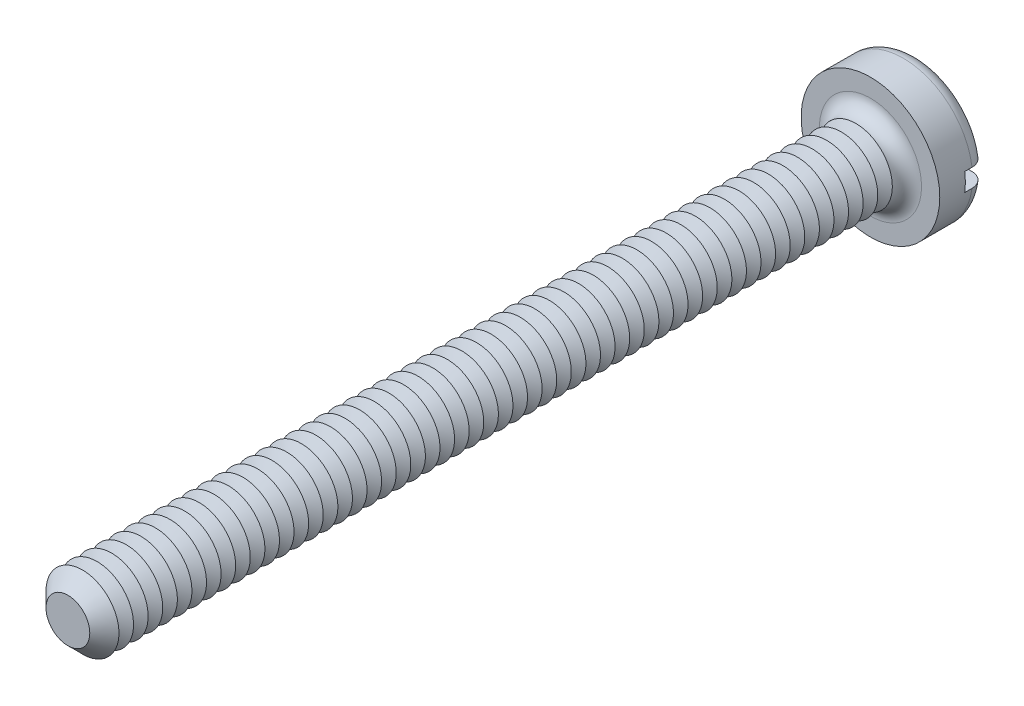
ISO-10303-21;
HEADER;
FILE_DESCRIPTION(('STEP AP214'),'2;1');
FILE_NAME('part.step','',(''),(''),'','','');
FILE_SCHEMA(('AUTOMOTIVE_DESIGN { 1 0 10303 214 1 1 1 1 }'));
ENDSEC;
DATA;
#1=APPLICATION_CONTEXT('core data for automotive mechanical design processes');
#2=APPLICATION_PROTOCOL_DEFINITION('international standard','automotive_design',2000,#1);
#3=PRODUCT_CONTEXT('',#1,'mechanical');
#4=PRODUCT('Part','Part','',(#3));
#5=PRODUCT_RELATED_PRODUCT_CATEGORY('part','',(#4));
#6=PRODUCT_DEFINITION_FORMATION('','',#4);
#7=PRODUCT_DEFINITION_CONTEXT('part definition',#1,'design');
#8=PRODUCT_DEFINITION('design','',#6,#7);
#9=PRODUCT_DEFINITION_SHAPE('','',#8);
#10=(LENGTH_UNIT() NAMED_UNIT(*) SI_UNIT(.MILLI.,.METRE.));
#11=(NAMED_UNIT(*) PLANE_ANGLE_UNIT() SI_UNIT($,.RADIAN.));
#12=(NAMED_UNIT(*) SI_UNIT($,.STERADIAN.) SOLID_ANGLE_UNIT());
#13=UNCERTAINTY_MEASURE_WITH_UNIT(LENGTH_MEASURE(1.E-05),#10,'distance_accuracy_value','');
#14=(GEOMETRIC_REPRESENTATION_CONTEXT(3) GLOBAL_UNCERTAINTY_ASSIGNED_CONTEXT((#13)) GLOBAL_UNIT_ASSIGNED_CONTEXT((#10,
#11,#12)) REPRESENTATION_CONTEXT('',''));
#15=CARTESIAN_POINT('',(0.,0.,0.));
#16=DIRECTION('',(0.,0.,1.));
#17=DIRECTION('',(1.,0.,0.));
#18=AXIS2_PLACEMENT_3D('',#15,#16,#17);
#19=CARTESIAN_POINT('',(0.,0.,-1.3));
#20=DIRECTION('',(0.,0.,1.));
#21=DIRECTION('',(1.,0.,0.));
#22=AXIS2_PLACEMENT_3D('',#19,#20,#21);
#23=PLANE('',#22);
#24=CARTESIAN_POINT('',(0.,0.,-1.3));
#25=DIRECTION('',(0.,0.,1.));
#26=DIRECTION('',(1.,0.,0.));
#27=AXIS2_PLACEMENT_3D('',#24,#25,#26);
#28=CIRCLE('',#27,1.5);
#29=CARTESIAN_POINT('',(-1.4790199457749,0.25,-1.3));
#30=VERTEX_POINT('',#29);
#31=CARTESIAN_POINT('',(1.4790199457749,0.25,-1.3));
#32=VERTEX_POINT('',#31);
#33=EDGE_CURVE('E116',#30,#32,#28,.F.);
#34=ORIENTED_EDGE('',*,*,#33,.T.);
#35=DIRECTION('',(1.,0.,0.));
#36=VECTOR('',#35,1.);
#37=CARTESIAN_POINT('',(-1.9,0.25,-1.3));
#38=LINE('',#37,#36);
#39=EDGE_CURVE('E111',#30,#32,#38,.T.);
#40=ORIENTED_EDGE('',*,*,#39,.F.);
#41=EDGE_LOOP('',(#34,#40));
#42=FACE_BOUND('',#41,.T.);
#43=ADVANCED_FACE('F39',(#42),#23,.F.);
#44=CARTESIAN_POINT('',(0.,0.,-0.9));
#45=DIRECTION('',(0.,0.,1.));
#46=DIRECTION('',(1.,0.,0.));
#47=AXIS2_PLACEMENT_3D('',#44,#45,#46);
#48=TOROIDAL_SURFACE('',#47,1.5,0.4);
#49=CARTESIAN_POINT('',(-1.8150392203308,0.25,-1.12284384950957));
#50=CARTESIAN_POINT('',(-1.80236980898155,0.25,-1.14155059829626));
#51=CARTESIAN_POINT('',(-1.78809920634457,0.25,-1.15919399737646));
#52=CARTESIAN_POINT('',(-1.75677844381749,0.25,-1.19184073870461));
#53=CARTESIAN_POINT('',(-1.73972468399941,0.25,-1.20684060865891));
#54=CARTESIAN_POINT('',(-1.70336024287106,0.25,-1.23375848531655));
#55=CARTESIAN_POINT('',(-1.68405164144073,0.25,-1.24567930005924));
#56=CARTESIAN_POINT('',(-1.64372549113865,0.25,-1.26613528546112));
#57=CARTESIAN_POINT('',(-1.6227083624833,0.25,-1.27467128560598));
#58=CARTESIAN_POINT('',(-1.57937988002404,0.25,-1.2881995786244));
#59=CARTESIAN_POINT('',(-1.55705957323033,0.25,-1.29316318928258));
#60=CARTESIAN_POINT('',(-1.51190394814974,0.25,-1.29931753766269));
#61=CARTESIAN_POINT('',(-1.48906857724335,0.25,-1.3005078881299));
#62=CARTESIAN_POINT('',(-1.4432641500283,0.25,-1.29909058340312));
#63=CARTESIAN_POINT('',(-1.42029638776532,0.25,-1.29644099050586));
#64=CARTESIAN_POINT('',(-1.37512297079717,0.25,-1.28735146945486));
#65=CARTESIAN_POINT('',(-1.3529173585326,0.25,-1.28091133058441));
#66=CARTESIAN_POINT('',(-1.30974098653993,0.25,-1.26436295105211));
#67=CARTESIAN_POINT('',(-1.28877978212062,0.25,-1.25422975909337));
#68=CARTESIAN_POINT('',(-1.24886205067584,0.25,-1.23057736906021));
#69=CARTESIAN_POINT('',(-1.22990554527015,0.25,-1.21705813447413));
#70=CARTESIAN_POINT('',(-1.19461911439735,0.25,-1.18704970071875));
#71=CARTESIAN_POINT('',(-1.17828051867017,0.25,-1.17057070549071));
#72=CARTESIAN_POINT('',(-1.14865897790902,0.25,-1.13506201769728));
#73=CARTESIAN_POINT('',(-1.13537576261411,0.25,-1.11603255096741));
#74=CARTESIAN_POINT('',(-1.11249827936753,0.25,-1.07630328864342));
#75=CARTESIAN_POINT('',(-1.10284494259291,0.25,-1.05563752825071));
#76=CARTESIAN_POINT('',(-1.08724024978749,0.25,-1.01295282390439));
#77=CARTESIAN_POINT('',(-1.08128829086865,0.25,-0.990934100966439));
#78=CARTESIAN_POINT('',(-1.07339124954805,0.25,-0.946722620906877));
#79=CARTESIAN_POINT('',(-1.07135558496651,0.25,-0.924546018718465));
#80=CARTESIAN_POINT('',(-1.07108722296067,0.25,-0.880170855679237));
#81=CARTESIAN_POINT('',(-1.07285419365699,0.25,-0.857972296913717));
#82=CARTESIAN_POINT('',(-1.0800838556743,0.25,-0.814463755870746));
#83=CARTESIAN_POINT('',(-1.08550159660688,0.25,-0.793146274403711));
#84=CARTESIAN_POINT('',(-1.09980522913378,0.25,-0.751709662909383));
#85=CARTESIAN_POINT('',(-1.10869126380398,0.25,-0.731590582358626));
#86=CARTESIAN_POINT('',(-1.12975121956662,0.25,-0.692901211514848));
#87=CARTESIAN_POINT('',(-1.14195627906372,0.25,-0.674347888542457));
#88=CARTESIAN_POINT('',(-1.1692428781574,0.25,-0.639494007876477));
#89=CARTESIAN_POINT('',(-1.18432473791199,0.25,-0.623193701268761));
#90=CARTESIAN_POINT('',(-1.21730350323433,0.25,-0.592916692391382));
#91=CARTESIAN_POINT('',(-1.23525650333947,0.25,-0.579001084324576));
#92=CARTESIAN_POINT('',(-1.27320799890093,0.25,-0.554314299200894));
#93=CARTESIAN_POINT('',(-1.2932067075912,0.25,-0.543543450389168));
#94=CARTESIAN_POINT('',(-1.33509120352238,0.25,-0.525253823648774));
#95=CARTESIAN_POINT('',(-1.35700545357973,0.25,-0.517800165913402));
#96=CARTESIAN_POINT('',(-1.401770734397,0.25,-0.506652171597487));
#97=CARTESIAN_POINT('',(-1.42462180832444,0.25,-0.502958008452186));
#98=CARTESIAN_POINT('',(-1.4707602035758,0.25,-0.499429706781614));
#99=CARTESIAN_POINT('',(-1.49404932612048,0.25,-0.499619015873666));
#100=CARTESIAN_POINT('',(-1.54026206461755,0.25,-0.50392615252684));
#101=CARTESIAN_POINT('',(-1.56318568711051,0.25,-0.508043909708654));
#102=CARTESIAN_POINT('',(-1.60788420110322,0.25,-0.520077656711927));
#103=CARTESIAN_POINT('',(-1.6296645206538,0.25,-0.527973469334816));
#104=CARTESIAN_POINT('',(-1.67156889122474,0.25,-0.547348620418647));
#105=CARTESIAN_POINT('',(-1.69169302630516,0.25,-0.558827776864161));
#106=CARTESIAN_POINT('',(-1.72948251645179,0.25,-0.584913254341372));
#107=CARTESIAN_POINT('',(-1.74717189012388,0.25,-0.599484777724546));
#108=CARTESIAN_POINT('',(-1.77981909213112,0.25,-0.63142070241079));
#109=CARTESIAN_POINT('',(-1.79477707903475,0.25,-0.648784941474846));
#110=CARTESIAN_POINT('',(-1.82136524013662,0.25,-0.685607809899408));
#111=CARTESIAN_POINT('',(-1.83303003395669,0.25,-0.705041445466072));
#112=CARTESIAN_POINT('',(-1.85289960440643,0.25,-0.745602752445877));
#113=CARTESIAN_POINT('',(-1.86110468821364,0.25,-0.76673027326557));
#114=CARTESIAN_POINT('',(-1.87375648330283,0.25,-0.809891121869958));
#115=CARTESIAN_POINT('',(-1.87823381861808,0.25,-0.831915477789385));
#116=CARTESIAN_POINT('',(-1.88341152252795,0.25,-0.87640983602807));
#117=CARTESIAN_POINT('',(-1.88411103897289,0.25,-0.898879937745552));
#118=CARTESIAN_POINT('',(-1.88171559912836,0.25,-0.943534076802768));
#119=CARTESIAN_POINT('',(-1.87863413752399,0.25,-0.965718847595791));
#120=CARTESIAN_POINT('',(-1.86879153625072,0.25,-1.00923650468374));
#121=CARTESIAN_POINT('',(-1.86203494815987,0.25,-1.03057040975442));
#122=CARTESIAN_POINT('',(-1.84837477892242,0.25,-1.06373797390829));
#123=CARTESIAN_POINT('',(-1.84255723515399,0.25,-1.07603047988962));
#124=CARTESIAN_POINT('',(-1.82969924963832,0.25,-1.09995814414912));
#125=CARTESIAN_POINT('',(-1.82265881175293,0.25,-1.11159330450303));
#126=CARTESIAN_POINT('',(-1.8150392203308,0.25,-1.12284384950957));
#127=B_SPLINE_CURVE_WITH_KNOTS('',3,(#49,#50,#51,#52,#53,#54,#55,#56,#57,#58,#59,#60,#61,#62,
#63,#64,#65,#66,#67,#68,#69,#70,#71,#72,#73,#74,#75,#76,#77,#78,#79,#80,#81,#82,#83,#84,#85,#86,
#87,#88,#89,#90,#91,#92,#93,#94,#95,#96,#97,#98,#99,#100,#101,#102,#103,#104,#105,#106,#107,
#108,#109,#110,#111,#112,#113,#114,#115,#116,#117,#118,#119,#120,#121,#122,#123,#124,#125,#126),
.UNSPECIFIED.,.T.,.F.,(4,2,2,2,2,2,2,2,2,2,2,2,2,2,2,2,2,2,2,2,2,2,2,2,2,2,2,2,2,2,2,2,2,2,2,2,
2,2,4),(0.,0.0677296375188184,0.135547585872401,0.203303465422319,0.27104273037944,
0.339319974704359,0.407604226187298,0.47663988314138,0.545679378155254,0.615194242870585,
0.684709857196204,0.753990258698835,0.82326452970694,0.891356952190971,0.959438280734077,
1.02592503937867,1.0924059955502,1.15808300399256,1.2237627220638,1.29008126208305,
1.35640718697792,1.4242376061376,1.49207510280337,1.5611911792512,1.63031044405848,
1.69984715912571,1.76938262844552,1.8385508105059,1.90771547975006,1.97613962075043,
2.04455978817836,2.11223135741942,2.17989691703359,2.24700094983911,2.31412011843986,
2.38100042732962,2.44779809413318,2.48853193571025,2.52926564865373),.UNSPECIFIED.);
#128=CARTESIAN_POINT('',(-1.88348082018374,0.25,-0.9));
#129=VERTEX_POINT('',#128);
#130=EDGE_CURVE('E603',#129,#30,#127,.T.);
#131=ORIENTED_EDGE('',*,*,#130,.F.);
#132=CARTESIAN_POINT('',(0.,0.,-0.9));
#133=DIRECTION('',(0.,0.,1.));
#134=DIRECTION('',(1.,0.,0.));
#135=AXIS2_PLACEMENT_3D('',#132,#133,#134);
#136=CIRCLE('',#135,1.9);
#137=CARTESIAN_POINT('',(1.88348082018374,0.25,-0.9));
#138=VERTEX_POINT('',#137);
#139=EDGE_CURVE('E125',#138,#129,#136,.T.);
#140=ORIENTED_EDGE('',*,*,#139,.F.);
#141=CARTESIAN_POINT('',(1.11362660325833,0.25,-1.07710243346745));
#142=CARTESIAN_POINT('',(1.12388366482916,0.25,-1.09736755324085));
#143=CARTESIAN_POINT('',(1.13589127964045,0.25,-1.11676768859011));
#144=CARTESIAN_POINT('',(1.16301945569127,0.25,-1.15328107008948));
#145=CARTESIAN_POINT('',(1.17814463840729,0.25,-1.17039085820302));
#146=CARTESIAN_POINT('',(1.21101661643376,0.25,-1.20182395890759));
#147=CARTESIAN_POINT('',(1.22875976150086,0.25,-1.21615108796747));
#148=CARTESIAN_POINT('',(1.26636392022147,0.25,-1.24166932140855));
#149=CARTESIAN_POINT('',(1.28622436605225,0.25,-1.25286126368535));
#150=CARTESIAN_POINT('',(1.32781377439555,0.25,-1.27196191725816));
#151=CARTESIAN_POINT('',(1.34956550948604,0.25,-1.27982107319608));
#152=CARTESIAN_POINT('',(1.39407620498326,0.25,-1.29180513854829));
#153=CARTESIAN_POINT('',(1.41683526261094,0.25,-1.29592968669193));
#154=CARTESIAN_POINT('',(1.46288034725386,0.25,-1.3003367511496));
#155=CARTESIAN_POINT('',(1.48616890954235,0.25,-1.30059287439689));
#156=CARTESIAN_POINT('',(1.53245605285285,0.25,-1.29717239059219));
#157=CARTESIAN_POINT('',(1.55545463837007,0.25,-1.29349584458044));
#158=CARTESIAN_POINT('',(1.60038828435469,0.25,-1.28232271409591));
#159=CARTESIAN_POINT('',(1.62232790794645,0.25,-1.27484449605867));
#160=CARTESIAN_POINT('',(1.66461970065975,0.25,-1.25627203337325));
#161=CARTESIAN_POINT('',(1.68497195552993,0.25,-1.24517798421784));
#162=CARTESIAN_POINT('',(1.72328060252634,0.25,-1.21981269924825));
#163=CARTESIAN_POINT('',(1.74126001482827,0.25,-1.2055762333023));
#164=CARTESIAN_POINT('',(1.77453973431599,0.25,-1.17425606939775));
#165=CARTESIAN_POINT('',(1.78984019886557,0.25,-1.1571725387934));
#166=CARTESIAN_POINT('',(1.81715014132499,0.25,-1.12084732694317));
#167=CARTESIAN_POINT('',(1.82919410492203,0.25,-1.10163156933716));
#168=CARTESIAN_POINT('',(1.84985315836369,0.25,-1.06143759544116));
#169=CARTESIAN_POINT('',(1.85846842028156,0.25,-1.04045946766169));
#170=CARTESIAN_POINT('',(1.87195437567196,0.25,-0.997526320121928));
#171=CARTESIAN_POINT('',(1.87685590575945,0.25,-0.975580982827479));
#172=CARTESIAN_POINT('',(1.88288741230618,0.25,-0.931178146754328));
#173=CARTESIAN_POINT('',(1.88401750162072,0.25,-0.908720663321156));
#174=CARTESIAN_POINT('',(1.88247598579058,0.25,-0.864033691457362));
#175=CARTESIAN_POINT('',(1.87982069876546,0.25,-0.841803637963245));
#176=CARTESIAN_POINT('',(1.87081646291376,0.25,-0.798104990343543));
#177=CARTESIAN_POINT('',(1.86446754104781,0.25,-0.776636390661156));
#178=CARTESIAN_POINT('',(1.84826063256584,0.25,-0.735060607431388));
#179=CARTESIAN_POINT('',(1.83840161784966,0.25,-0.714953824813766));
#180=CARTESIAN_POINT('',(1.81546327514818,0.25,-0.676670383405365));
#181=CARTESIAN_POINT('',(1.80238389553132,0.25,-0.658493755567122));
#182=CARTESIAN_POINT('',(1.77331327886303,0.25,-0.62448916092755));
#183=CARTESIAN_POINT('',(1.75730833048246,0.25,-0.608672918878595));
#184=CARTESIAN_POINT('',(1.72289038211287,0.25,-0.579924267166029));
#185=CARTESIAN_POINT('',(1.70447729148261,0.25,-0.566991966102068));
#186=CARTESIAN_POINT('',(1.66559643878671,0.25,-0.544254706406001));
#187=CARTESIAN_POINT('',(1.64511218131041,0.25,-0.53447796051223));
#188=CARTESIAN_POINT('',(1.60280554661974,0.25,-0.518459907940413));
#189=CARTESIAN_POINT('',(1.58098309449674,0.25,-0.512218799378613));
#190=CARTESIAN_POINT('',(1.53636184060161,0.25,-0.503375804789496));
#191=CARTESIAN_POINT('',(1.51355490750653,0.25,-0.500814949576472));
#192=CARTESIAN_POINT('',(1.46783245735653,0.25,-0.499516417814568));
#193=CARTESIAN_POINT('',(1.44491693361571,0.25,-0.500778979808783));
#194=CARTESIAN_POINT('',(1.39937748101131,0.25,-0.50711284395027));
#195=CARTESIAN_POINT('',(1.37675897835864,0.25,-0.512223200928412));
#196=CARTESIAN_POINT('',(1.33269286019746,0.25,-0.526151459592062));
#197=CARTESIAN_POINT('',(1.31124530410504,0.25,-0.534969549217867));
#198=CARTESIAN_POINT('',(1.27004097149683,0.25,-0.556118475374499));
#199=CARTESIAN_POINT('',(1.25029179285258,0.25,-0.568464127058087));
#200=CARTESIAN_POINT('',(1.21316554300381,0.25,-0.59631968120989));
#201=CARTESIAN_POINT('',(1.19578844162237,0.25,-0.611829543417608));
#202=CARTESIAN_POINT('',(1.16406059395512,0.25,-0.645459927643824));
#203=CARTESIAN_POINT('',(1.14968747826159,0.25,-0.663559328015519));
#204=CARTESIAN_POINT('',(1.12425968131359,0.25,-0.70195566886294));
#205=CARTESIAN_POINT('',(1.11320445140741,0.25,-0.722252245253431));
#206=CARTESIAN_POINT('',(1.09497726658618,0.25,-0.764020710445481));
#207=CARTESIAN_POINT('',(1.08772970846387,0.25,-0.785459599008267));
#208=CARTESIAN_POINT('',(1.07702618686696,0.25,-0.829269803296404));
#209=CARTESIAN_POINT('',(1.07357062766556,0.25,-0.851641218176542));
#210=CARTESIAN_POINT('',(1.07060826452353,0.25,-0.896160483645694));
#211=CARTESIAN_POINT('',(1.07101876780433,0.25,-0.918302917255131));
#212=CARTESIAN_POINT('',(1.07557730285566,0.25,-0.962179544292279));
#213=CARTESIAN_POINT('',(1.07972048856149,0.25,-0.983914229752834));
#214=CARTESIAN_POINT('',(1.08912066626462,0.25,-1.01754924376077));
#215=CARTESIAN_POINT('',(1.09320341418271,0.25,-1.02979035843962));
#216=CARTESIAN_POINT('',(1.10254493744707,0.25,-1.05381470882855));
#217=CARTESIAN_POINT('',(1.10780368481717,0.25,-1.06559795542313));
#218=CARTESIAN_POINT('',(1.11362660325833,0.25,-1.07710243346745));
#219=B_SPLINE_CURVE_WITH_KNOTS('',3,(#141,#142,#143,#144,#145,#146,#147,#148,#149,#150,#151,
#152,#153,#154,#155,#156,#157,#158,#159,#160,#161,#162,#163,#164,#165,#166,#167,#168,#169,#170,
#171,#172,#173,#174,#175,#176,#177,#178,#179,#180,#181,#182,#183,#184,#185,#186,#187,#188,#189,
#190,#191,#192,#193,#194,#195,#196,#197,#198,#199,#200,#201,#202,#203,#204,#205,#206,#207,#208,
#209,#210,#211,#212,#213,#214,#215,#216,#217,#218),.UNSPECIFIED.,.T.,.F.,(4,2,2,2,2,2,2,2,2,2,2,
2,2,2,2,2,2,2,2,2,2,2,2,2,2,2,2,2,2,2,2,2,2,2,2,2,2,2,4),(0.,0.0680907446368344,
0.136283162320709,0.204381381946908,0.272461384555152,0.341520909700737,0.410587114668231,
0.480124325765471,0.549660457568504,0.618863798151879,0.688063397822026,0.756532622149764,
0.824997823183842,0.892706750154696,0.960412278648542,1.02754926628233,1.09468424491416,
1.16153068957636,1.22837664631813,1.29524219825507,1.36210882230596,1.42929726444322,
1.49648823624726,1.56426429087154,1.63204414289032,1.70057395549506,1.76910804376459,
1.83834728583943,1.90759003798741,1.97712798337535,2.0466650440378,2.11566422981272,
2.18465199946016,2.25221259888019,2.3197804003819,2.38590630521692,2.45194648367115,
2.49060241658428,2.5292574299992),.UNSPECIFIED.);
#220=EDGE_CURVE('E605',#32,#138,#219,.T.);
#221=ORIENTED_EDGE('',*,*,#220,.F.);
#222=ORIENTED_EDGE('',*,*,#33,.F.);
#223=EDGE_LOOP('',(#131,#140,#221,#222));
#224=FACE_BOUND('',#223,.T.);
#225=ADVANCED_FACE('F587',(#224),#48,.T.);
#226=CARTESIAN_POINT('',(0.,0.,-1.3));
#227=DIRECTION('',(0.,0.,1.));
#228=DIRECTION('',(1.,0.,0.));
#229=AXIS2_PLACEMENT_3D('',#226,#227,#228);
#230=CYLINDRICAL_SURFACE('',#229,1.9);
#231=DIRECTION('',(0.,0.,1.));
#232=VECTOR('',#231,1.);
#233=CARTESIAN_POINT('',(1.88348082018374,0.25,-1.3));
#234=LINE('',#233,#232);
#235=CARTESIAN_POINT('',(1.88348082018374,0.25,-0.7));
#236=VERTEX_POINT('',#235);
#237=EDGE_CURVE('E618',#138,#236,#234,.T.);
#238=ORIENTED_EDGE('',*,*,#237,.F.);
#239=ORIENTED_EDGE('',*,*,#139,.T.);
#240=DIRECTION('',(0.,0.,1.));
#241=VECTOR('',#240,1.);
#242=CARTESIAN_POINT('',(-1.88348082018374,0.25,-1.3));
#243=LINE('',#242,#241);
#244=CARTESIAN_POINT('',(-1.88348082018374,0.25,-0.7));
#245=VERTEX_POINT('',#244);
#246=EDGE_CURVE('E63',#245,#129,#243,.F.);
#247=ORIENTED_EDGE('',*,*,#246,.F.);
#248=CARTESIAN_POINT('',(0.,0.,-0.7));
#249=DIRECTION('',(0.,0.,-1.));
#250=DIRECTION('',(-1.,0.,0.));
#251=AXIS2_PLACEMENT_3D('',#248,#249,#250);
#252=CIRCLE('',#251,1.9);
#253=CARTESIAN_POINT('',(-1.88348082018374,-0.25,-0.7));
#254=VERTEX_POINT('',#253);
#255=EDGE_CURVE('E43',#245,#254,#252,.F.);
#256=ORIENTED_EDGE('',*,*,#255,.T.);
#257=DIRECTION('',(0.,0.,1.));
#258=VECTOR('',#257,1.);
#259=CARTESIAN_POINT('',(-1.88348082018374,-0.25,-1.3));
#260=LINE('',#259,#258);
#261=CARTESIAN_POINT('',(-1.88348082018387,-0.25,-0.899999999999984));
#262=VERTEX_POINT('',#261);
#263=EDGE_CURVE('E615',#262,#254,#260,.T.);
#264=ORIENTED_EDGE('',*,*,#263,.F.);
#265=CARTESIAN_POINT('',(1.88348082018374,-0.25,-0.9));
#266=VERTEX_POINT('',#265);
#267=EDGE_CURVE('E127',#262,#266,#136,.T.);
#268=ORIENTED_EDGE('',*,*,#267,.T.);
#269=DIRECTION('',(0.,0.,1.));
#270=VECTOR('',#269,1.);
#271=CARTESIAN_POINT('',(1.88348082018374,-0.25,-1.3));
#272=LINE('',#271,#270);
#273=CARTESIAN_POINT('',(1.88348082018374,-0.25,-0.7));
#274=VERTEX_POINT('',#273);
#275=EDGE_CURVE('E55',#274,#266,#272,.F.);
#276=ORIENTED_EDGE('',*,*,#275,.F.);
#277=EDGE_CURVE('E11',#274,#236,#252,.F.);
#278=ORIENTED_EDGE('',*,*,#277,.T.);
#279=EDGE_LOOP('',(#238,#239,#247,#256,#264,#268,#276,#278));
#280=FACE_BOUND('',#279,.T.);
#281=CARTESIAN_POINT('',(0.,0.,0.));
#282=DIRECTION('',(0.,0.,1.));
#283=DIRECTION('',(1.,0.,0.));
#284=AXIS2_PLACEMENT_3D('',#281,#282,#283);
#285=CIRCLE('',#284,1.9);
#286=CARTESIAN_POINT('',(1.9,0.,0.));
#287=VERTEX_POINT('',#286);
#288=EDGE_CURVE('E621',#287,#287,#285,.T.);
#289=ORIENTED_EDGE('',*,*,#288,.F.);
#290=EDGE_LOOP('',(#289));
#291=FACE_BOUND('',#290,.T.);
#292=ADVANCED_FACE('F583',(#280,#291),#230,.T.);
#293=CARTESIAN_POINT('',(1.4790199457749,-0.25,-1.3));
#294=VERTEX_POINT('',#293);
#295=CARTESIAN_POINT('',(-1.4790199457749,-0.25,-1.3));
#296=VERTEX_POINT('',#295);
#297=EDGE_CURVE('E109',#294,#296,#28,.F.);
#298=ORIENTED_EDGE('',*,*,#297,.T.);
#299=DIRECTION('',(-1.,0.,0.));
#300=VECTOR('',#299,1.);
#301=CARTESIAN_POINT('',(-1.9,-0.25,-1.3));
#302=LINE('',#301,#300);
#303=EDGE_CURVE('E96',#294,#296,#302,.T.);
#304=ORIENTED_EDGE('',*,*,#303,.F.);
#305=EDGE_LOOP('',(#298,#304));
#306=FACE_BOUND('',#305,.T.);
#307=ADVANCED_FACE('F108',(#306),#23,.F.);
#308=CARTESIAN_POINT('',(0.,0.,0.));
#309=DIRECTION('',(0.,0.,1.));
#310=DIRECTION('',(1.,0.,0.));
#311=AXIS2_PLACEMENT_3D('',#308,#309,#310);
#312=PLANE('',#311);
#313=CARTESIAN_POINT('',(0.,0.,0.));
#314=DIRECTION('',(0.,0.,1.));
#315=DIRECTION('',(1.,0.,0.));
#316=AXIS2_PLACEMENT_3D('',#313,#314,#315);
#317=CIRCLE('',#316,1.4);
#318=CARTESIAN_POINT('',(1.4,0.,0.));
#319=VERTEX_POINT('',#318);
#320=EDGE_CURVE('E115',#319,#319,#317,.F.);
#321=ORIENTED_EDGE('',*,*,#320,.T.);
#322=EDGE_LOOP('',(#321));
#323=FACE_BOUND('',#322,.T.);
#324=ORIENTED_EDGE('',*,*,#288,.T.);
#325=EDGE_LOOP('',(#324));
#326=FACE_BOUND('',#325,.T.);
#327=ADVANCED_FACE('F582',(#323,#326),#312,.T.);
#328=CARTESIAN_POINT('',(-1.8150392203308,-0.25,-1.12284384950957));
#329=CARTESIAN_POINT('',(-1.82756185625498,-0.25,-1.10435021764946));
#330=CARTESIAN_POINT('',(-1.83853807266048,-0.25,-1.08479072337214));
#331=CARTESIAN_POINT('',(-1.85706233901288,-0.25,-1.04409188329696));
#332=CARTESIAN_POINT('',(-1.86460655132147,-0.25,-1.02295079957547));
#333=CARTESIAN_POINT('',(-1.87603074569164,-0.25,-0.979704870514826));
#334=CARTESIAN_POINT('',(-1.87991177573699,-0.25,-0.957600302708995));
#335=CARTESIAN_POINT('',(-1.88389586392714,-0.25,-0.913058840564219));
#336=CARTESIAN_POINT('',(-1.88399981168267,-0.25,-0.890622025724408));
#337=CARTESIAN_POINT('',(-1.88043374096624,-0.25,-0.846104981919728));
#338=CARTESIAN_POINT('',(-1.87677281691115,-0.25,-0.824024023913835));
#339=CARTESIAN_POINT('',(-1.86579880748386,-0.25,-0.780788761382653));
#340=CARTESIAN_POINT('',(-1.85848560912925,-0.25,-0.759634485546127));
#341=CARTESIAN_POINT('',(-1.8404137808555,-0.25,-0.718830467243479));
#342=CARTESIAN_POINT('',(-1.82965205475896,-0.25,-0.699182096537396));
#343=CARTESIAN_POINT('',(-1.80499939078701,-0.25,-0.661958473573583));
#344=CARTESIAN_POINT('',(-1.7911083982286,-0.25,-0.644383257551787));
#345=CARTESIAN_POINT('',(-1.76051564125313,-0.25,-0.611699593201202));
#346=CARTESIAN_POINT('',(-1.74379913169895,-0.25,-0.596604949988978));
#347=CARTESIAN_POINT('',(-1.70808901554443,-0.25,-0.569406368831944));
#348=CARTESIAN_POINT('',(-1.68909532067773,-0.25,-0.557302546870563));
#349=CARTESIAN_POINT('',(-1.64918615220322,-0.25,-0.536307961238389));
#350=CARTESIAN_POINT('',(-1.62825469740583,-0.25,-0.527447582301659));
#351=CARTESIAN_POINT('',(-1.58521203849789,-0.25,-0.513323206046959));
#352=CARTESIAN_POINT('',(-1.5631007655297,-0.25,-0.508059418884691));
#353=CARTESIAN_POINT('',(-1.51806209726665,-0.25,-0.501215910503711));
#354=CARTESIAN_POINT('',(-1.4951283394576,-0.25,-0.499678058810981));
#355=CARTESIAN_POINT('',(-1.4493239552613,-0.25,-0.500434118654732));
#356=CARTESIAN_POINT('',(-1.4264533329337,-0.25,-0.502728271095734));
#357=CARTESIAN_POINT('',(-1.38118643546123,-0.25,-0.511115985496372));
#358=CARTESIAN_POINT('',(-1.35879703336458,-0.25,-0.51724667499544));
#359=CARTESIAN_POINT('',(-1.31535851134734,-0.25,-0.533167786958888));
#360=CARTESIAN_POINT('',(-1.29430945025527,-0.25,-0.542958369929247));
#361=CARTESIAN_POINT('',(-1.25409242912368,-0.25,-0.565968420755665));
#362=CARTESIAN_POINT('',(-1.23493023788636,-0.25,-0.579197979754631));
#363=CARTESIAN_POINT('',(-1.19912477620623,-0.25,-0.608715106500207));
#364=CARTESIAN_POINT('',(-1.18248143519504,-0.25,-0.625002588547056));
#365=CARTESIAN_POINT('',(-1.15237533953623,-0.25,-0.660018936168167));
#366=CARTESIAN_POINT('',(-1.13888343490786,-0.25,-0.678722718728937));
#367=CARTESIAN_POINT('',(-1.115312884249,-0.25,-0.718170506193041));
#368=CARTESIAN_POINT('',(-1.10523377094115,-0.25,-0.738914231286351));
#369=CARTESIAN_POINT('',(-1.08901310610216,-0.25,-0.781372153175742));
#370=CARTESIAN_POINT('',(-1.08279080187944,-0.25,-0.803055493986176));
#371=CARTESIAN_POINT('',(-1.07416105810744,-0.25,-0.847167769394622));
#372=CARTESIAN_POINT('',(-1.07175306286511,-0.25,-0.869596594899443));
#373=CARTESIAN_POINT('',(-1.07084656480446,-0.25,-0.914070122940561));
#374=CARTESIAN_POINT('',(-1.07226874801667,-0.25,-0.936113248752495));
#375=CARTESIAN_POINT('',(-1.07880428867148,-0.25,-0.979644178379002));
#376=CARTESIAN_POINT('',(-1.08391755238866,-0.25,-1.00113199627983));
#377=CARTESIAN_POINT('',(-1.09764616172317,-0.25,-1.04290115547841));
#378=CARTESIAN_POINT('',(-1.10625346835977,-0.25,-1.06318514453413));
#379=CARTESIAN_POINT('',(-1.12669365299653,-0.25,-1.10205584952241));
#380=CARTESIAN_POINT('',(-1.13852679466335,-0.25,-1.12064242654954));
#381=CARTESIAN_POINT('',(-1.16529672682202,-0.25,-1.15594801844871));
#382=CARTESIAN_POINT('',(-1.18028464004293,-0.25,-1.17262825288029));
#383=CARTESIAN_POINT('',(-1.21279183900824,-0.25,-1.20330600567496));
#384=CARTESIAN_POINT('',(-1.23031142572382,-0.25,-1.21730320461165));
#385=CARTESIAN_POINT('',(-1.26781695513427,-0.25,-1.24254670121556));
#386=CARTESIAN_POINT('',(-1.28784999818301,-0.25,-1.25372305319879));
#387=CARTESIAN_POINT('',(-1.3294899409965,-0.25,-1.27260611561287));
#388=CARTESIAN_POINT('',(-1.35109697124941,-0.25,-1.28031253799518));
#389=CARTESIAN_POINT('',(-1.39558575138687,-0.25,-1.29212626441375));
#390=CARTESIAN_POINT('',(-1.4184807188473,-0.25,-1.29618386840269));
#391=CARTESIAN_POINT('',(-1.4646266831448,-0.25,-1.30039947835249));
#392=CARTESIAN_POINT('',(-1.48787767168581,-0.25,-1.30055757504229));
#393=CARTESIAN_POINT('',(-1.53407883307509,-0.25,-1.29695468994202));
#394=CARTESIAN_POINT('',(-1.55702895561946,-0.25,-1.29319306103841));
#395=CARTESIAN_POINT('',(-1.60196718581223,-0.25,-1.28183520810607));
#396=CARTESIAN_POINT('',(-1.62395508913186,-0.25,-1.27423817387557));
#397=CARTESIAN_POINT('',(-1.66614393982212,-0.25,-1.25548646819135));
#398=CARTESIAN_POINT('',(-1.68635782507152,-0.25,-1.24436087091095));
#399=CARTESIAN_POINT('',(-1.72458266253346,-0.25,-1.21884344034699));
#400=CARTESIAN_POINT('',(-1.74259637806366,-0.25,-1.20445577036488));
#401=CARTESIAN_POINT('',(-1.76968989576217,-0.25,-1.1787247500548));
#402=CARTESIAN_POINT('',(-1.77959984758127,-0.25,-1.1682407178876));
#403=CARTESIAN_POINT('',(-1.79823423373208,-0.25,-1.14626700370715));
#404=CARTESIAN_POINT('',(-1.80695867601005,-0.25,-1.1347773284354));
#405=CARTESIAN_POINT('',(-1.8150392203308,-0.25,-1.12284384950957));
#406=B_SPLINE_CURVE_WITH_KNOTS('',3,(#328,#329,#330,#331,#332,#333,#334,#335,#336,#337,#338,
#339,#340,#341,#342,#343,#344,#345,#346,#347,#348,#349,#350,#351,#352,#353,#354,#355,#356,#357,
#358,#359,#360,#361,#362,#363,#364,#365,#366,#367,#368,#369,#370,#371,#372,#373,#374,#375,#376,
#377,#378,#379,#380,#381,#382,#383,#384,#385,#386,#387,#388,#389,#390,#391,#392,#393,#394,#395,
#396,#397,#398,#399,#400,#401,#402,#403,#404,#405),.UNSPECIFIED.,.T.,.F.,(4,2,2,2,2,2,2,2,2,2,2,
2,2,2,2,2,2,2,2,2,2,2,2,2,2,2,2,2,2,2,2,2,2,2,2,2,2,2,4),(0.,0.0669512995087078,
0.133977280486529,0.200984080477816,0.267975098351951,0.334804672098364,0.401636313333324,
0.468528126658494,0.535421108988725,0.602674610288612,0.669930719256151,0.737801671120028,
0.805676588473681,0.87431077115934,0.942949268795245,1.0122625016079,1.08157877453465,
1.15110078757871,1.22062085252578,1.28946987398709,1.35830946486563,1.42565417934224,
1.49298908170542,1.55894041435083,1.62489007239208,1.69068884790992,1.75649300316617,
1.82345932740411,1.89043361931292,1.95893391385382,2.02743989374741,2.09686543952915,
2.16628937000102,2.23572476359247,2.3051748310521,2.3740669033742,2.44287154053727,
2.48607383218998,2.52927583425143),.UNSPECIFIED.);
#407=EDGE_CURVE('E103',#296,#262,#406,.T.);
#408=ORIENTED_EDGE('',*,*,#407,.F.);
#409=ORIENTED_EDGE('',*,*,#297,.F.);
#410=CARTESIAN_POINT('',(1.11362660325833,-0.25,-1.07710243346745));
#411=CARTESIAN_POINT('',(1.10368387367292,-0.25,-1.05745397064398));
#412=CARTESIAN_POINT('',(1.09537204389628,-0.25,-1.0369644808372));
#413=CARTESIAN_POINT('',(1.08229212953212,-0.25,-0.994867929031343));
#414=CARTESIAN_POINT('',(1.07752732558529,-0.25,-0.973259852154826));
#415=CARTESIAN_POINT('',(1.07171197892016,-0.25,-0.929545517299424));
#416=CARTESIAN_POINT('',(1.07066166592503,-0.25,-0.907439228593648));
#417=CARTESIAN_POINT('',(1.07231382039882,-0.25,-0.863372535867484));
#418=CARTESIAN_POINT('',(1.07501551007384,-0.25,-0.841412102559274));
#419=CARTESIAN_POINT('',(1.08404966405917,-0.25,-0.798386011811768));
#420=CARTESIAN_POINT('',(1.09036099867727,-0.25,-0.777315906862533));
#421=CARTESIAN_POINT('',(1.10638973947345,-0.25,-0.736514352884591));
#422=CARTESIAN_POINT('',(1.11610743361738,-0.25,-0.716783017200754));
#423=CARTESIAN_POINT('',(1.13878208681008,-0.25,-0.678952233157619));
#424=CARTESIAN_POINT('',(1.15177705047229,-0.25,-0.660875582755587));
#425=CARTESIAN_POINT('',(1.18055347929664,-0.25,-0.62709692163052));
#426=CARTESIAN_POINT('',(1.19633525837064,-0.25,-0.611395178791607));
#427=CARTESIAN_POINT('',(1.23062926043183,-0.25,-0.582430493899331));
#428=CARTESIAN_POINT('',(1.24919608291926,-0.25,-0.569232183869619));
#429=CARTESIAN_POINT('',(1.28825118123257,-0.25,-0.546076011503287));
#430=CARTESIAN_POINT('',(1.30873964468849,-0.25,-0.536118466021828));
#431=CARTESIAN_POINT('',(1.35144534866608,-0.25,-0.519560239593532));
#432=CARTESIAN_POINT('',(1.3736865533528,-0.25,-0.513021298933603));
#433=CARTESIAN_POINT('',(1.41894945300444,-0.25,-0.503751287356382));
#434=CARTESIAN_POINT('',(1.44197117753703,-0.25,-0.50102036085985));
#435=CARTESIAN_POINT('',(1.48824913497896,-0.25,-0.499449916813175));
#436=CARTESIAN_POINT('',(1.5115059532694,-0.25,-0.500627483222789));
#437=CARTESIAN_POINT('',(1.55748678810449,-0.25,-0.506895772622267));
#438=CARTESIAN_POINT('',(1.58021081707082,-0.25,-0.511986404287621));
#439=CARTESIAN_POINT('',(1.6243247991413,-0.25,-0.525910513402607));
#440=CARTESIAN_POINT('',(1.64572225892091,-0.25,-0.534720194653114));
#441=CARTESIAN_POINT('',(1.68671060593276,-0.25,-0.555845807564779));
#442=CARTESIAN_POINT('',(1.70630159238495,-0.25,-0.568161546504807));
#443=CARTESIAN_POINT('',(1.74289060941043,-0.25,-0.595805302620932));
#444=CARTESIAN_POINT('',(1.75991474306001,-0.25,-0.611098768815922));
#445=CARTESIAN_POINT('',(1.79111916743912,-0.25,-0.644354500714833));
#446=CARTESIAN_POINT('',(1.80529962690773,-0.25,-0.662316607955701));
#447=CARTESIAN_POINT('',(1.83025525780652,-0.25,-0.700191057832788));
#448=CARTESIAN_POINT('',(1.84106535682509,-0.25,-0.720080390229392));
#449=CARTESIAN_POINT('',(1.8591630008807,-0.25,-0.761401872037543));
#450=CARTESIAN_POINT('',(1.86645070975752,-0.25,-0.782833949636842));
#451=CARTESIAN_POINT('',(1.87724305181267,-0.25,-0.826454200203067));
#452=CARTESIAN_POINT('',(1.88077646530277,-0.25,-0.848635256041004));
#453=CARTESIAN_POINT('',(1.88405487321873,-0.25,-0.89327539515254));
#454=CARTESIAN_POINT('',(1.88379996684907,-0.25,-0.915734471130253));
#455=CARTESIAN_POINT('',(1.87951702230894,-0.25,-0.96021054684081));
#456=CARTESIAN_POINT('',(1.87550211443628,-0.25,-0.982228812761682));
#457=CARTESIAN_POINT('',(1.86383665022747,-0.25,-1.0252797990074));
#458=CARTESIAN_POINT('',(1.85618610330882,-0.25,-1.04631252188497));
#459=CARTESIAN_POINT('',(1.83746332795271,-0.25,-1.08682395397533));
#460=CARTESIAN_POINT('',(1.82638722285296,-0.25,-1.10630087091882));
#461=CARTESIAN_POINT('',(1.80113946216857,-0.25,-1.14313202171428));
#462=CARTESIAN_POINT('',(1.78696774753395,-0.25,-1.1604862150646));
#463=CARTESIAN_POINT('',(1.75585044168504,-0.25,-1.19268694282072));
#464=CARTESIAN_POINT('',(1.73888979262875,-0.25,-1.20751892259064));
#465=CARTESIAN_POINT('',(1.7027387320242,-0.25,-1.23415579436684));
#466=CARTESIAN_POINT('',(1.68354822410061,-0.25,-1.24596055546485));
#467=CARTESIAN_POINT('',(1.64329341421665,-0.25,-1.26632784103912));
#468=CARTESIAN_POINT('',(1.62221336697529,-0.25,-1.27485924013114));
#469=CARTESIAN_POINT('',(1.5789301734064,-0.25,-1.28830571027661));
#470=CARTESIAN_POINT('',(1.55672695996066,-0.25,-1.29322056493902));
#471=CARTESIAN_POINT('',(1.5115614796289,-0.25,-1.29935191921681));
#472=CARTESIAN_POINT('',(1.4885934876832,-0.25,-1.30052625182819));
#473=CARTESIAN_POINT('',(1.44278240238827,-0.25,-1.2990417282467));
#474=CARTESIAN_POINT('',(1.41993931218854,-0.25,-1.29638277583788));
#475=CARTESIAN_POINT('',(1.37479511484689,-0.25,-1.28727159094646));
#476=CARTESIAN_POINT('',(1.35250125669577,-0.25,-1.2807834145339));
#477=CARTESIAN_POINT('',(1.30930729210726,-0.25,-1.2641644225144));
#478=CARTESIAN_POINT('',(1.2884075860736,-0.25,-1.25403256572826));
#479=CARTESIAN_POINT('',(1.24854853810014,-0.25,-1.23036781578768));
#480=CARTESIAN_POINT('',(1.22959511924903,-0.25,-1.21682495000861));
#481=CARTESIAN_POINT('',(1.19427766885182,-0.25,-1.18672803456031));
#482=CARTESIAN_POINT('',(1.17791048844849,-0.25,-1.170177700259));
#483=CARTESIAN_POINT('',(1.15346856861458,-0.25,-1.14079355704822));
#484=CARTESIAN_POINT('',(1.14449891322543,-0.25,-1.12869247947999));
#485=CARTESIAN_POINT('',(1.12797460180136,-0.25,-1.10355927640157));
#486=CARTESIAN_POINT('',(1.1204199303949,-0.25,-1.09052716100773));
#487=CARTESIAN_POINT('',(1.11362660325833,-0.25,-1.07710243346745));
#488=B_SPLINE_CURVE_WITH_KNOTS('',3,(#410,#411,#412,#413,#414,#415,#416,#417,#418,#419,#420,
#421,#422,#423,#424,#425,#426,#427,#428,#429,#430,#431,#432,#433,#434,#435,#436,#437,#438,#439,
#440,#441,#442,#443,#444,#445,#446,#447,#448,#449,#450,#451,#452,#453,#454,#455,#456,#457,#458,
#459,#460,#461,#462,#463,#464,#465,#466,#467,#468,#469,#470,#471,#472,#473,#474,#475,#476,#477,
#478,#479,#480,#481,#482,#483,#484,#485,#486,#487),.UNSPECIFIED.,.T.,.F.,(4,2,2,2,2,2,2,2,2,2,2,
2,2,2,2,2,2,2,2,2,2,2,2,2,2,2,2,2,2,2,2,2,2,2,2,2,2,2,4),(0.,0.0660089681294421,
0.132078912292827,0.198152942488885,0.26421327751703,0.329890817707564,0.395573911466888,
0.462056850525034,0.528547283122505,0.596571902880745,0.664603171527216,0.733823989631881,
0.803047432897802,0.872573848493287,0.94209864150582,1.01118516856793,1.08026789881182,
1.14859228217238,1.21691261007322,1.28449938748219,1.35208302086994,1.41914473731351,
1.48620469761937,1.55303134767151,1.61985782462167,1.68676020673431,1.75366386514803,
1.82094137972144,1.88822180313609,1.95612699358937,2.0240362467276,2.09270838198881,
2.16138224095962,2.23071121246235,2.30006001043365,2.36961396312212,2.4390825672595,
2.48418340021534,2.52928374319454),.UNSPECIFIED.);
#489=EDGE_CURVE('E92',#266,#294,#488,.T.);
#490=ORIENTED_EDGE('',*,*,#489,.F.);
#491=ORIENTED_EDGE('',*,*,#267,.F.);
#492=EDGE_LOOP('',(#408,#409,#490,#491));
#493=FACE_BOUND('',#492,.T.);
#494=ADVANCED_FACE('F113',(#493),#48,.T.);
#495=CARTESIAN_POINT('',(0.,0.,0.400000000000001));
#496=DIRECTION('',(0.,0.,1.));
#497=DIRECTION('',(1.,0.,0.));
#498=AXIS2_PLACEMENT_3D('',#495,#496,#497);
#499=TOROIDAL_SURFACE('',#498,1.4,0.4);
#500=ORIENTED_EDGE('',*,*,#320,.F.);
#501=EDGE_LOOP('',(#500));
#502=FACE_BOUND('',#501,.T.);
#503=CARTESIAN_POINT('',(0.,0.,0.400000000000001));
#504=DIRECTION('',(0.,0.,-1.));
#505=DIRECTION('',(-1.,0.,0.));
#506=AXIS2_PLACEMENT_3D('',#503,#504,#505);
#507=CIRCLE('',#506,1.);
#508=CARTESIAN_POINT('',(-1.,0.,0.400000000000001));
#509=VERTEX_POINT('',#508);
#510=EDGE_CURVE('E627',#509,#509,#507,.T.);
#511=ORIENTED_EDGE('',*,*,#510,.T.);
#512=EDGE_LOOP('',(#511));
#513=FACE_BOUND('',#512,.T.);
#514=ADVANCED_FACE('F575',(#502,#513),#499,.F.);
#515=CARTESIAN_POINT('',(0.,0.,0.600000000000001));
#516=DIRECTION('',(0.,0.,-1.));
#517=DIRECTION('',(-1.,0.,0.));
#518=AXIS2_PLACEMENT_3D('',#515,#516,#517);
#519=CONICAL_SURFACE('',#518,0.653589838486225,1.0471975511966);
#520=ORIENTED_EDGE('',*,*,#510,.F.);
#521=EDGE_LOOP('',(#520));
#522=FACE_BOUND('',#521,.T.);
#523=CARTESIAN_POINT('',(0.,0.,0.600000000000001));
#524=DIRECTION('',(0.,0.,-1.));
#525=DIRECTION('',(-1.,0.,0.));
#526=AXIS2_PLACEMENT_3D('',#523,#524,#525);
#527=CIRCLE('',#526,0.653589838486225);
#528=CARTESIAN_POINT('',(-0.653589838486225,0.,0.600000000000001));
#529=VERTEX_POINT('',#528);
#530=EDGE_CURVE('E634',#529,#529,#527,.T.);
#531=ORIENTED_EDGE('',*,*,#530,.T.);
#532=EDGE_LOOP('',(#531));
#533=FACE_BOUND('',#532,.T.);
#534=ADVANCED_FACE('F571',(#522,#533),#519,.T.);
#535=CARTESIAN_POINT('',(0.,0.,0.800000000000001));
#536=DIRECTION('',(0.,0.,1.));
#537=DIRECTION('',(1.,0.,0.));
#538=AXIS2_PLACEMENT_3D('',#535,#536,#537);
#539=CONICAL_SURFACE('',#538,1.,1.0471975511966);
#540=ORIENTED_EDGE('',*,*,#530,.F.);
#541=EDGE_LOOP('',(#540));
#542=FACE_BOUND('',#541,.T.);
#543=CARTESIAN_POINT('',(0.,0.,0.800000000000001));
#544=DIRECTION('',(0.,0.,-1.));
#545=DIRECTION('',(-1.,0.,0.));
#546=AXIS2_PLACEMENT_3D('',#543,#544,#545);
#547=CIRCLE('',#546,1.);
#548=CARTESIAN_POINT('',(-1.,0.,0.800000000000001));
#549=VERTEX_POINT('',#548);
#550=EDGE_CURVE('E640',#549,#549,#547,.T.);
#551=ORIENTED_EDGE('',*,*,#550,.T.);
#552=EDGE_LOOP('',(#551));
#553=FACE_BOUND('',#552,.T.);
#554=ADVANCED_FACE('F567',(#542,#553),#539,.T.);
#555=CARTESIAN_POINT('',(0.,0.,1.));
#556=DIRECTION('',(0.,0.,-1.));
#557=DIRECTION('',(-1.,0.,0.));
#558=AXIS2_PLACEMENT_3D('',#555,#556,#557);
#559=CONICAL_SURFACE('',#558,0.653589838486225,1.0471975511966);
#560=ORIENTED_EDGE('',*,*,#550,.F.);
#561=EDGE_LOOP('',(#560));
#562=FACE_BOUND('',#561,.T.);
#563=CARTESIAN_POINT('',(0.,0.,1.));
#564=DIRECTION('',(0.,0.,-1.));
#565=DIRECTION('',(-1.,0.,0.));
#566=AXIS2_PLACEMENT_3D('',#563,#564,#565);
#567=CIRCLE('',#566,0.653589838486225);
#568=CARTESIAN_POINT('',(-0.653589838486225,0.,1.));
#569=VERTEX_POINT('',#568);
#570=EDGE_CURVE('E644',#569,#569,#567,.T.);
#571=ORIENTED_EDGE('',*,*,#570,.T.);
#572=EDGE_LOOP('',(#571));
#573=FACE_BOUND('',#572,.T.);
#574=ADVANCED_FACE('F563',(#562,#573),#559,.T.);
#575=CARTESIAN_POINT('',(0.,0.,1.2));
#576=DIRECTION('',(0.,0.,1.));
#577=DIRECTION('',(1.,0.,0.));
#578=AXIS2_PLACEMENT_3D('',#575,#576,#577);
#579=CONICAL_SURFACE('',#578,1.,1.0471975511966);
#580=ORIENTED_EDGE('',*,*,#570,.F.);
#581=EDGE_LOOP('',(#580));
#582=FACE_BOUND('',#581,.T.);
#583=CARTESIAN_POINT('',(0.,0.,1.2));
#584=DIRECTION('',(0.,0.,-1.));
#585=DIRECTION('',(-1.,0.,0.));
#586=AXIS2_PLACEMENT_3D('',#583,#584,#585);
#587=CIRCLE('',#586,1.);
#588=CARTESIAN_POINT('',(-1.,0.,1.2));
#589=VERTEX_POINT('',#588);
#590=EDGE_CURVE('E648',#589,#589,#587,.T.);
#591=ORIENTED_EDGE('',*,*,#590,.T.);
#592=EDGE_LOOP('',(#591));
#593=FACE_BOUND('',#592,.T.);
#594=ADVANCED_FACE('F559',(#582,#593),#579,.T.);
#595=CARTESIAN_POINT('',(0.,0.,1.4));
#596=DIRECTION('',(0.,0.,-1.));
#597=DIRECTION('',(-1.,0.,0.));
#598=AXIS2_PLACEMENT_3D('',#595,#596,#597);
#599=CONICAL_SURFACE('',#598,0.653589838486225,1.0471975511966);
#600=ORIENTED_EDGE('',*,*,#590,.F.);
#601=EDGE_LOOP('',(#600));
#602=FACE_BOUND('',#601,.T.);
#603=CARTESIAN_POINT('',(0.,0.,1.4));
#604=DIRECTION('',(0.,0.,-1.));
#605=DIRECTION('',(-1.,0.,0.));
#606=AXIS2_PLACEMENT_3D('',#603,#604,#605);
#607=CIRCLE('',#606,0.653589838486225);
#608=CARTESIAN_POINT('',(-0.653589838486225,0.,1.4));
#609=VERTEX_POINT('',#608);
#610=EDGE_CURVE('E651',#609,#609,#607,.T.);
#611=ORIENTED_EDGE('',*,*,#610,.T.);
#612=EDGE_LOOP('',(#611));
#613=FACE_BOUND('',#612,.T.);
#614=ADVANCED_FACE('F555',(#602,#613),#599,.T.);
#615=CARTESIAN_POINT('',(0.,0.,1.6));
#616=DIRECTION('',(0.,0.,1.));
#617=DIRECTION('',(1.,0.,0.));
#618=AXIS2_PLACEMENT_3D('',#615,#616,#617);
#619=CONICAL_SURFACE('',#618,1.,1.0471975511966);
#620=ORIENTED_EDGE('',*,*,#610,.F.);
#621=EDGE_LOOP('',(#620));
#622=FACE_BOUND('',#621,.T.);
#623=CARTESIAN_POINT('',(0.,0.,1.6));
#624=DIRECTION('',(0.,0.,-1.));
#625=DIRECTION('',(-1.,0.,0.));
#626=AXIS2_PLACEMENT_3D('',#623,#624,#625);
#627=CIRCLE('',#626,1.);
#628=CARTESIAN_POINT('',(-1.,0.,1.6));
#629=VERTEX_POINT('',#628);
#630=EDGE_CURVE('E655',#629,#629,#627,.T.);
#631=ORIENTED_EDGE('',*,*,#630,.T.);
#632=EDGE_LOOP('',(#631));
#633=FACE_BOUND('',#632,.T.);
#634=ADVANCED_FACE('F551',(#622,#633),#619,.T.);
#635=CARTESIAN_POINT('',(0.,0.,1.8));
#636=DIRECTION('',(0.,0.,-1.));
#637=DIRECTION('',(-1.,0.,0.));
#638=AXIS2_PLACEMENT_3D('',#635,#636,#637);
#639=CONICAL_SURFACE('',#638,0.653589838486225,1.0471975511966);
#640=ORIENTED_EDGE('',*,*,#630,.F.);
#641=EDGE_LOOP('',(#640));
#642=FACE_BOUND('',#641,.T.);
#643=CARTESIAN_POINT('',(0.,0.,1.8));
#644=DIRECTION('',(0.,0.,-1.));
#645=DIRECTION('',(-1.,0.,0.));
#646=AXIS2_PLACEMENT_3D('',#643,#644,#645);
#647=CIRCLE('',#646,0.653589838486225);
#648=CARTESIAN_POINT('',(-0.653589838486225,0.,1.8));
#649=VERTEX_POINT('',#648);
#650=EDGE_CURVE('E659',#649,#649,#647,.T.);
#651=ORIENTED_EDGE('',*,*,#650,.T.);
#652=EDGE_LOOP('',(#651));
#653=FACE_BOUND('',#652,.T.);
#654=ADVANCED_FACE('F547',(#642,#653),#639,.T.);
#655=CARTESIAN_POINT('',(0.,0.,2.));
#656=DIRECTION('',(0.,0.,1.));
#657=DIRECTION('',(1.,0.,0.));
#658=AXIS2_PLACEMENT_3D('',#655,#656,#657);
#659=CONICAL_SURFACE('',#658,1.,1.0471975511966);
#660=ORIENTED_EDGE('',*,*,#650,.F.);
#661=EDGE_LOOP('',(#660));
#662=FACE_BOUND('',#661,.T.);
#663=CARTESIAN_POINT('',(0.,0.,2.));
#664=DIRECTION('',(0.,0.,-1.));
#665=DIRECTION('',(-1.,0.,0.));
#666=AXIS2_PLACEMENT_3D('',#663,#664,#665);
#667=CIRCLE('',#666,1.);
#668=CARTESIAN_POINT('',(-1.,0.,2.));
#669=VERTEX_POINT('',#668);
#670=EDGE_CURVE('E662',#669,#669,#667,.T.);
#671=ORIENTED_EDGE('',*,*,#670,.T.);
#672=EDGE_LOOP('',(#671));
#673=FACE_BOUND('',#672,.T.);
#674=ADVANCED_FACE('F543',(#662,#673),#659,.T.);
#675=CARTESIAN_POINT('',(0.,0.,2.2));
#676=DIRECTION('',(0.,0.,-1.));
#677=DIRECTION('',(-1.,0.,0.));
#678=AXIS2_PLACEMENT_3D('',#675,#676,#677);
#679=CONICAL_SURFACE('',#678,0.653589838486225,1.0471975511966);
#680=ORIENTED_EDGE('',*,*,#670,.F.);
#681=EDGE_LOOP('',(#680));
#682=FACE_BOUND('',#681,.T.);
#683=CARTESIAN_POINT('',(0.,0.,2.2));
#684=DIRECTION('',(0.,0.,-1.));
#685=DIRECTION('',(-1.,0.,0.));
#686=AXIS2_PLACEMENT_3D('',#683,#684,#685);
#687=CIRCLE('',#686,0.653589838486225);
#688=CARTESIAN_POINT('',(-0.653589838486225,0.,2.2));
#689=VERTEX_POINT('',#688);
#690=EDGE_CURVE('E666',#689,#689,#687,.T.);
#691=ORIENTED_EDGE('',*,*,#690,.T.);
#692=EDGE_LOOP('',(#691));
#693=FACE_BOUND('',#692,.T.);
#694=ADVANCED_FACE('F539',(#682,#693),#679,.T.);
#695=CARTESIAN_POINT('',(0.,0.,2.4));
#696=DIRECTION('',(0.,0.,1.));
#697=DIRECTION('',(1.,0.,0.));
#698=AXIS2_PLACEMENT_3D('',#695,#696,#697);
#699=CONICAL_SURFACE('',#698,1.,1.0471975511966);
#700=ORIENTED_EDGE('',*,*,#690,.F.);
#701=EDGE_LOOP('',(#700));
#702=FACE_BOUND('',#701,.T.);
#703=CARTESIAN_POINT('',(0.,0.,2.4));
#704=DIRECTION('',(0.,0.,-1.));
#705=DIRECTION('',(-1.,0.,0.));
#706=AXIS2_PLACEMENT_3D('',#703,#704,#705);
#707=CIRCLE('',#706,1.);
#708=CARTESIAN_POINT('',(-1.,0.,2.4));
#709=VERTEX_POINT('',#708);
#710=EDGE_CURVE('E670',#709,#709,#707,.T.);
#711=ORIENTED_EDGE('',*,*,#710,.T.);
#712=EDGE_LOOP('',(#711));
#713=FACE_BOUND('',#712,.T.);
#714=ADVANCED_FACE('F535',(#702,#713),#699,.T.);
#715=CARTESIAN_POINT('',(0.,0.,2.6));
#716=DIRECTION('',(0.,0.,-1.));
#717=DIRECTION('',(-1.,0.,0.));
#718=AXIS2_PLACEMENT_3D('',#715,#716,#717);
#719=CONICAL_SURFACE('',#718,0.653589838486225,1.0471975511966);
#720=ORIENTED_EDGE('',*,*,#710,.F.);
#721=EDGE_LOOP('',(#720));
#722=FACE_BOUND('',#721,.T.);
#723=CARTESIAN_POINT('',(0.,0.,2.6));
#724=DIRECTION('',(0.,0.,-1.));
#725=DIRECTION('',(-1.,0.,0.));
#726=AXIS2_PLACEMENT_3D('',#723,#724,#725);
#727=CIRCLE('',#726,0.653589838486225);
#728=CARTESIAN_POINT('',(-0.653589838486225,0.,2.6));
#729=VERTEX_POINT('',#728);
#730=EDGE_CURVE('E674',#729,#729,#727,.T.);
#731=ORIENTED_EDGE('',*,*,#730,.T.);
#732=EDGE_LOOP('',(#731));
#733=FACE_BOUND('',#732,.T.);
#734=ADVANCED_FACE('F531',(#722,#733),#719,.T.);
#735=CARTESIAN_POINT('',(0.,0.,2.8));
#736=DIRECTION('',(0.,0.,1.));
#737=DIRECTION('',(1.,0.,0.));
#738=AXIS2_PLACEMENT_3D('',#735,#736,#737);
#739=CONICAL_SURFACE('',#738,1.,1.0471975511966);
#740=ORIENTED_EDGE('',*,*,#730,.F.);
#741=EDGE_LOOP('',(#740));
#742=FACE_BOUND('',#741,.T.);
#743=CARTESIAN_POINT('',(0.,0.,2.8));
#744=DIRECTION('',(0.,0.,-1.));
#745=DIRECTION('',(-1.,0.,0.));
#746=AXIS2_PLACEMENT_3D('',#743,#744,#745);
#747=CIRCLE('',#746,1.);
#748=CARTESIAN_POINT('',(-1.,0.,2.8));
#749=VERTEX_POINT('',#748);
#750=EDGE_CURVE('E678',#749,#749,#747,.T.);
#751=ORIENTED_EDGE('',*,*,#750,.T.);
#752=EDGE_LOOP('',(#751));
#753=FACE_BOUND('',#752,.T.);
#754=ADVANCED_FACE('F527',(#742,#753),#739,.T.);
#755=CARTESIAN_POINT('',(0.,0.,3.));
#756=DIRECTION('',(0.,0.,-1.));
#757=DIRECTION('',(-1.,0.,0.));
#758=AXIS2_PLACEMENT_3D('',#755,#756,#757);
#759=CONICAL_SURFACE('',#758,0.653589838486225,1.0471975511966);
#760=ORIENTED_EDGE('',*,*,#750,.F.);
#761=EDGE_LOOP('',(#760));
#762=FACE_BOUND('',#761,.T.);
#763=CARTESIAN_POINT('',(0.,0.,3.));
#764=DIRECTION('',(0.,0.,-1.));
#765=DIRECTION('',(-1.,0.,0.));
#766=AXIS2_PLACEMENT_3D('',#763,#764,#765);
#767=CIRCLE('',#766,0.653589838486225);
#768=CARTESIAN_POINT('',(-0.653589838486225,0.,3.));
#769=VERTEX_POINT('',#768);
#770=EDGE_CURVE('E682',#769,#769,#767,.T.);
#771=ORIENTED_EDGE('',*,*,#770,.T.);
#772=EDGE_LOOP('',(#771));
#773=FACE_BOUND('',#772,.T.);
#774=ADVANCED_FACE('F523',(#762,#773),#759,.T.);
#775=CARTESIAN_POINT('',(0.,0.,3.2));
#776=DIRECTION('',(0.,0.,1.));
#777=DIRECTION('',(1.,0.,0.));
#778=AXIS2_PLACEMENT_3D('',#775,#776,#777);
#779=CONICAL_SURFACE('',#778,1.,1.0471975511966);
#780=ORIENTED_EDGE('',*,*,#770,.F.);
#781=EDGE_LOOP('',(#780));
#782=FACE_BOUND('',#781,.T.);
#783=CARTESIAN_POINT('',(0.,0.,3.2));
#784=DIRECTION('',(0.,0.,-1.));
#785=DIRECTION('',(-1.,0.,0.));
#786=AXIS2_PLACEMENT_3D('',#783,#784,#785);
#787=CIRCLE('',#786,1.);
#788=CARTESIAN_POINT('',(-1.,0.,3.2));
#789=VERTEX_POINT('',#788);
#790=EDGE_CURVE('E686',#789,#789,#787,.T.);
#791=ORIENTED_EDGE('',*,*,#790,.T.);
#792=EDGE_LOOP('',(#791));
#793=FACE_BOUND('',#792,.T.);
#794=ADVANCED_FACE('F519',(#782,#793),#779,.T.);
#795=CARTESIAN_POINT('',(0.,0.,3.4));
#796=DIRECTION('',(0.,0.,-1.));
#797=DIRECTION('',(-1.,0.,0.));
#798=AXIS2_PLACEMENT_3D('',#795,#796,#797);
#799=CONICAL_SURFACE('',#798,0.653589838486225,1.0471975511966);
#800=ORIENTED_EDGE('',*,*,#790,.F.);
#801=EDGE_LOOP('',(#800));
#802=FACE_BOUND('',#801,.T.);
#803=CARTESIAN_POINT('',(0.,0.,3.4));
#804=DIRECTION('',(0.,0.,-1.));
#805=DIRECTION('',(-1.,0.,0.));
#806=AXIS2_PLACEMENT_3D('',#803,#804,#805);
#807=CIRCLE('',#806,0.653589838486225);
#808=CARTESIAN_POINT('',(-0.653589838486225,0.,3.4));
#809=VERTEX_POINT('',#808);
#810=EDGE_CURVE('E690',#809,#809,#807,.T.);
#811=ORIENTED_EDGE('',*,*,#810,.T.);
#812=EDGE_LOOP('',(#811));
#813=FACE_BOUND('',#812,.T.);
#814=ADVANCED_FACE('F515',(#802,#813),#799,.T.);
#815=CARTESIAN_POINT('',(0.,0.,3.6));
#816=DIRECTION('',(0.,0.,1.));
#817=DIRECTION('',(1.,0.,0.));
#818=AXIS2_PLACEMENT_3D('',#815,#816,#817);
#819=CONICAL_SURFACE('',#818,1.,1.0471975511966);
#820=ORIENTED_EDGE('',*,*,#810,.F.);
#821=EDGE_LOOP('',(#820));
#822=FACE_BOUND('',#821,.T.);
#823=CARTESIAN_POINT('',(0.,0.,3.6));
#824=DIRECTION('',(0.,0.,-1.));
#825=DIRECTION('',(-1.,0.,0.));
#826=AXIS2_PLACEMENT_3D('',#823,#824,#825);
#827=CIRCLE('',#826,1.);
#828=CARTESIAN_POINT('',(-1.,0.,3.6));
#829=VERTEX_POINT('',#828);
#830=EDGE_CURVE('E694',#829,#829,#827,.T.);
#831=ORIENTED_EDGE('',*,*,#830,.T.);
#832=EDGE_LOOP('',(#831));
#833=FACE_BOUND('',#832,.T.);
#834=ADVANCED_FACE('F511',(#822,#833),#819,.T.);
#835=CARTESIAN_POINT('',(0.,0.,3.8));
#836=DIRECTION('',(0.,0.,-1.));
#837=DIRECTION('',(-1.,0.,0.));
#838=AXIS2_PLACEMENT_3D('',#835,#836,#837);
#839=CONICAL_SURFACE('',#838,0.653589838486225,1.0471975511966);
#840=ORIENTED_EDGE('',*,*,#830,.F.);
#841=EDGE_LOOP('',(#840));
#842=FACE_BOUND('',#841,.T.);
#843=CARTESIAN_POINT('',(0.,0.,3.8));
#844=DIRECTION('',(0.,0.,-1.));
#845=DIRECTION('',(-1.,0.,0.));
#846=AXIS2_PLACEMENT_3D('',#843,#844,#845);
#847=CIRCLE('',#846,0.653589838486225);
#848=CARTESIAN_POINT('',(-0.653589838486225,0.,3.8));
#849=VERTEX_POINT('',#848);
#850=EDGE_CURVE('E698',#849,#849,#847,.T.);
#851=ORIENTED_EDGE('',*,*,#850,.T.);
#852=EDGE_LOOP('',(#851));
#853=FACE_BOUND('',#852,.T.);
#854=ADVANCED_FACE('F507',(#842,#853),#839,.T.);
#855=CARTESIAN_POINT('',(0.,0.,4.));
#856=DIRECTION('',(0.,0.,1.));
#857=DIRECTION('',(1.,0.,0.));
#858=AXIS2_PLACEMENT_3D('',#855,#856,#857);
#859=CONICAL_SURFACE('',#858,1.,1.0471975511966);
#860=ORIENTED_EDGE('',*,*,#850,.F.);
#861=EDGE_LOOP('',(#860));
#862=FACE_BOUND('',#861,.T.);
#863=CARTESIAN_POINT('',(0.,0.,4.));
#864=DIRECTION('',(0.,0.,-1.));
#865=DIRECTION('',(-1.,0.,0.));
#866=AXIS2_PLACEMENT_3D('',#863,#864,#865);
#867=CIRCLE('',#866,1.);
#868=CARTESIAN_POINT('',(-1.,0.,4.));
#869=VERTEX_POINT('',#868);
#870=EDGE_CURVE('E702',#869,#869,#867,.T.);
#871=ORIENTED_EDGE('',*,*,#870,.T.);
#872=EDGE_LOOP('',(#871));
#873=FACE_BOUND('',#872,.T.);
#874=ADVANCED_FACE('F503',(#862,#873),#859,.T.);
#875=CARTESIAN_POINT('',(0.,0.,4.2));
#876=DIRECTION('',(0.,0.,-1.));
#877=DIRECTION('',(-1.,0.,0.));
#878=AXIS2_PLACEMENT_3D('',#875,#876,#877);
#879=CONICAL_SURFACE('',#878,0.653589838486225,1.0471975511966);
#880=ORIENTED_EDGE('',*,*,#870,.F.);
#881=EDGE_LOOP('',(#880));
#882=FACE_BOUND('',#881,.T.);
#883=CARTESIAN_POINT('',(0.,0.,4.2));
#884=DIRECTION('',(0.,0.,-1.));
#885=DIRECTION('',(-1.,0.,0.));
#886=AXIS2_PLACEMENT_3D('',#883,#884,#885);
#887=CIRCLE('',#886,0.653589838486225);
#888=CARTESIAN_POINT('',(-0.653589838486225,0.,4.2));
#889=VERTEX_POINT('',#888);
#890=EDGE_CURVE('E706',#889,#889,#887,.T.);
#891=ORIENTED_EDGE('',*,*,#890,.T.);
#892=EDGE_LOOP('',(#891));
#893=FACE_BOUND('',#892,.T.);
#894=ADVANCED_FACE('F499',(#882,#893),#879,.T.);
#895=CARTESIAN_POINT('',(0.,0.,4.4));
#896=DIRECTION('',(0.,0.,1.));
#897=DIRECTION('',(1.,0.,0.));
#898=AXIS2_PLACEMENT_3D('',#895,#896,#897);
#899=CONICAL_SURFACE('',#898,1.,1.0471975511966);
#900=ORIENTED_EDGE('',*,*,#890,.F.);
#901=EDGE_LOOP('',(#900));
#902=FACE_BOUND('',#901,.T.);
#903=CARTESIAN_POINT('',(0.,0.,4.4));
#904=DIRECTION('',(0.,0.,-1.));
#905=DIRECTION('',(-1.,0.,0.));
#906=AXIS2_PLACEMENT_3D('',#903,#904,#905);
#907=CIRCLE('',#906,1.);
#908=CARTESIAN_POINT('',(-1.,0.,4.4));
#909=VERTEX_POINT('',#908);
#910=EDGE_CURVE('E710',#909,#909,#907,.T.);
#911=ORIENTED_EDGE('',*,*,#910,.T.);
#912=EDGE_LOOP('',(#911));
#913=FACE_BOUND('',#912,.T.);
#914=ADVANCED_FACE('F495',(#902,#913),#899,.T.);
#915=CARTESIAN_POINT('',(0.,0.,4.6));
#916=DIRECTION('',(0.,0.,-1.));
#917=DIRECTION('',(-1.,0.,0.));
#918=AXIS2_PLACEMENT_3D('',#915,#916,#917);
#919=CONICAL_SURFACE('',#918,0.653589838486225,1.0471975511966);
#920=ORIENTED_EDGE('',*,*,#910,.F.);
#921=EDGE_LOOP('',(#920));
#922=FACE_BOUND('',#921,.T.);
#923=CARTESIAN_POINT('',(0.,0.,4.6));
#924=DIRECTION('',(0.,0.,-1.));
#925=DIRECTION('',(-1.,0.,0.));
#926=AXIS2_PLACEMENT_3D('',#923,#924,#925);
#927=CIRCLE('',#926,0.653589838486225);
#928=CARTESIAN_POINT('',(-0.653589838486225,0.,4.6));
#929=VERTEX_POINT('',#928);
#930=EDGE_CURVE('E714',#929,#929,#927,.T.);
#931=ORIENTED_EDGE('',*,*,#930,.T.);
#932=EDGE_LOOP('',(#931));
#933=FACE_BOUND('',#932,.T.);
#934=ADVANCED_FACE('F491',(#922,#933),#919,.T.);
#935=CARTESIAN_POINT('',(0.,0.,4.8));
#936=DIRECTION('',(0.,0.,1.));
#937=DIRECTION('',(1.,0.,0.));
#938=AXIS2_PLACEMENT_3D('',#935,#936,#937);
#939=CONICAL_SURFACE('',#938,1.,1.0471975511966);
#940=ORIENTED_EDGE('',*,*,#930,.F.);
#941=EDGE_LOOP('',(#940));
#942=FACE_BOUND('',#941,.T.);
#943=CARTESIAN_POINT('',(0.,0.,4.8));
#944=DIRECTION('',(0.,0.,-1.));
#945=DIRECTION('',(-1.,0.,0.));
#946=AXIS2_PLACEMENT_3D('',#943,#944,#945);
#947=CIRCLE('',#946,1.);
#948=CARTESIAN_POINT('',(-1.,0.,4.8));
#949=VERTEX_POINT('',#948);
#950=EDGE_CURVE('E718',#949,#949,#947,.T.);
#951=ORIENTED_EDGE('',*,*,#950,.T.);
#952=EDGE_LOOP('',(#951));
#953=FACE_BOUND('',#952,.T.);
#954=ADVANCED_FACE('F487',(#942,#953),#939,.T.);
#955=CARTESIAN_POINT('',(0.,0.,5.));
#956=DIRECTION('',(0.,0.,-1.));
#957=DIRECTION('',(-1.,0.,0.));
#958=AXIS2_PLACEMENT_3D('',#955,#956,#957);
#959=CONICAL_SURFACE('',#958,0.653589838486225,1.0471975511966);
#960=ORIENTED_EDGE('',*,*,#950,.F.);
#961=EDGE_LOOP('',(#960));
#962=FACE_BOUND('',#961,.T.);
#963=CARTESIAN_POINT('',(0.,0.,5.));
#964=DIRECTION('',(0.,0.,-1.));
#965=DIRECTION('',(-1.,0.,0.));
#966=AXIS2_PLACEMENT_3D('',#963,#964,#965);
#967=CIRCLE('',#966,0.653589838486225);
#968=CARTESIAN_POINT('',(-0.653589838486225,0.,5.));
#969=VERTEX_POINT('',#968);
#970=EDGE_CURVE('E722',#969,#969,#967,.T.);
#971=ORIENTED_EDGE('',*,*,#970,.T.);
#972=EDGE_LOOP('',(#971));
#973=FACE_BOUND('',#972,.T.);
#974=ADVANCED_FACE('F483',(#962,#973),#959,.T.);
#975=CARTESIAN_POINT('',(0.,0.,5.2));
#976=DIRECTION('',(0.,0.,1.));
#977=DIRECTION('',(1.,0.,0.));
#978=AXIS2_PLACEMENT_3D('',#975,#976,#977);
#979=CONICAL_SURFACE('',#978,1.,1.0471975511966);
#980=ORIENTED_EDGE('',*,*,#970,.F.);
#981=EDGE_LOOP('',(#980));
#982=FACE_BOUND('',#981,.T.);
#983=CARTESIAN_POINT('',(0.,0.,5.2));
#984=DIRECTION('',(0.,0.,-1.));
#985=DIRECTION('',(-1.,0.,0.));
#986=AXIS2_PLACEMENT_3D('',#983,#984,#985);
#987=CIRCLE('',#986,1.);
#988=CARTESIAN_POINT('',(-1.,0.,5.2));
#989=VERTEX_POINT('',#988);
#990=EDGE_CURVE('E726',#989,#989,#987,.T.);
#991=ORIENTED_EDGE('',*,*,#990,.T.);
#992=EDGE_LOOP('',(#991));
#993=FACE_BOUND('',#992,.T.);
#994=ADVANCED_FACE('F479',(#982,#993),#979,.T.);
#995=CARTESIAN_POINT('',(0.,0.,5.4));
#996=DIRECTION('',(0.,0.,-1.));
#997=DIRECTION('',(-1.,0.,0.));
#998=AXIS2_PLACEMENT_3D('',#995,#996,#997);
#999=CONICAL_SURFACE('',#998,0.653589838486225,1.0471975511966);
#1000=ORIENTED_EDGE('',*,*,#990,.F.);
#1001=EDGE_LOOP('',(#1000));
#1002=FACE_BOUND('',#1001,.T.);
#1003=CARTESIAN_POINT('',(0.,0.,5.4));
#1004=DIRECTION('',(0.,0.,-1.));
#1005=DIRECTION('',(-1.,0.,0.));
#1006=AXIS2_PLACEMENT_3D('',#1003,#1004,#1005);
#1007=CIRCLE('',#1006,0.653589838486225);
#1008=CARTESIAN_POINT('',(-0.653589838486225,0.,5.4));
#1009=VERTEX_POINT('',#1008);
#1010=EDGE_CURVE('E729',#1009,#1009,#1007,.T.);
#1011=ORIENTED_EDGE('',*,*,#1010,.T.);
#1012=EDGE_LOOP('',(#1011));
#1013=FACE_BOUND('',#1012,.T.);
#1014=ADVANCED_FACE('F475',(#1002,#1013),#999,.T.);
#1015=CARTESIAN_POINT('',(0.,0.,5.6));
#1016=DIRECTION('',(0.,0.,1.));
#1017=DIRECTION('',(1.,0.,0.));
#1018=AXIS2_PLACEMENT_3D('',#1015,#1016,#1017);
#1019=CONICAL_SURFACE('',#1018,1.,1.0471975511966);
#1020=ORIENTED_EDGE('',*,*,#1010,.F.);
#1021=EDGE_LOOP('',(#1020));
#1022=FACE_BOUND('',#1021,.T.);
#1023=CARTESIAN_POINT('',(0.,0.,5.6));
#1024=DIRECTION('',(0.,0.,-1.));
#1025=DIRECTION('',(-1.,0.,0.));
#1026=AXIS2_PLACEMENT_3D('',#1023,#1024,#1025);
#1027=CIRCLE('',#1026,1.);
#1028=CARTESIAN_POINT('',(-1.,0.,5.6));
#1029=VERTEX_POINT('',#1028);
#1030=EDGE_CURVE('E733',#1029,#1029,#1027,.T.);
#1031=ORIENTED_EDGE('',*,*,#1030,.T.);
#1032=EDGE_LOOP('',(#1031));
#1033=FACE_BOUND('',#1032,.T.);
#1034=ADVANCED_FACE('F471',(#1022,#1033),#1019,.T.);
#1035=CARTESIAN_POINT('',(0.,0.,5.8));
#1036=DIRECTION('',(0.,0.,-1.));
#1037=DIRECTION('',(-1.,0.,0.));
#1038=AXIS2_PLACEMENT_3D('',#1035,#1036,#1037);
#1039=CONICAL_SURFACE('',#1038,0.653589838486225,1.0471975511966);
#1040=ORIENTED_EDGE('',*,*,#1030,.F.);
#1041=EDGE_LOOP('',(#1040));
#1042=FACE_BOUND('',#1041,.T.);
#1043=CARTESIAN_POINT('',(0.,0.,5.8));
#1044=DIRECTION('',(0.,0.,-1.));
#1045=DIRECTION('',(-1.,0.,0.));
#1046=AXIS2_PLACEMENT_3D('',#1043,#1044,#1045);
#1047=CIRCLE('',#1046,0.653589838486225);
#1048=CARTESIAN_POINT('',(-0.653589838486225,0.,5.8));
#1049=VERTEX_POINT('',#1048);
#1050=EDGE_CURVE('E737',#1049,#1049,#1047,.T.);
#1051=ORIENTED_EDGE('',*,*,#1050,.T.);
#1052=EDGE_LOOP('',(#1051));
#1053=FACE_BOUND('',#1052,.T.);
#1054=ADVANCED_FACE('F467',(#1042,#1053),#1039,.T.);
#1055=CARTESIAN_POINT('',(0.,0.,6.));
#1056=DIRECTION('',(0.,0.,1.));
#1057=DIRECTION('',(1.,0.,0.));
#1058=AXIS2_PLACEMENT_3D('',#1055,#1056,#1057);
#1059=CONICAL_SURFACE('',#1058,1.,1.0471975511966);
#1060=ORIENTED_EDGE('',*,*,#1050,.F.);
#1061=EDGE_LOOP('',(#1060));
#1062=FACE_BOUND('',#1061,.T.);
#1063=CARTESIAN_POINT('',(0.,0.,6.));
#1064=DIRECTION('',(0.,0.,-1.));
#1065=DIRECTION('',(-1.,0.,0.));
#1066=AXIS2_PLACEMENT_3D('',#1063,#1064,#1065);
#1067=CIRCLE('',#1066,1.);
#1068=CARTESIAN_POINT('',(-1.,0.,6.));
#1069=VERTEX_POINT('',#1068);
#1070=EDGE_CURVE('E740',#1069,#1069,#1067,.T.);
#1071=ORIENTED_EDGE('',*,*,#1070,.T.);
#1072=EDGE_LOOP('',(#1071));
#1073=FACE_BOUND('',#1072,.T.);
#1074=ADVANCED_FACE('F463',(#1062,#1073),#1059,.T.);
#1075=CARTESIAN_POINT('',(0.,0.,6.2));
#1076=DIRECTION('',(0.,0.,-1.));
#1077=DIRECTION('',(-1.,0.,0.));
#1078=AXIS2_PLACEMENT_3D('',#1075,#1076,#1077);
#1079=CONICAL_SURFACE('',#1078,0.653589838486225,1.0471975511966);
#1080=ORIENTED_EDGE('',*,*,#1070,.F.);
#1081=EDGE_LOOP('',(#1080));
#1082=FACE_BOUND('',#1081,.T.);
#1083=CARTESIAN_POINT('',(0.,0.,6.2));
#1084=DIRECTION('',(0.,0.,-1.));
#1085=DIRECTION('',(-1.,0.,0.));
#1086=AXIS2_PLACEMENT_3D('',#1083,#1084,#1085);
#1087=CIRCLE('',#1086,0.653589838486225);
#1088=CARTESIAN_POINT('',(-0.653589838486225,0.,6.2));
#1089=VERTEX_POINT('',#1088);
#1090=EDGE_CURVE('E744',#1089,#1089,#1087,.T.);
#1091=ORIENTED_EDGE('',*,*,#1090,.T.);
#1092=EDGE_LOOP('',(#1091));
#1093=FACE_BOUND('',#1092,.T.);
#1094=ADVANCED_FACE('F459',(#1082,#1093),#1079,.T.);
#1095=CARTESIAN_POINT('',(0.,0.,6.4));
#1096=DIRECTION('',(0.,0.,1.));
#1097=DIRECTION('',(1.,0.,0.));
#1098=AXIS2_PLACEMENT_3D('',#1095,#1096,#1097);
#1099=CONICAL_SURFACE('',#1098,1.,1.0471975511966);
#1100=ORIENTED_EDGE('',*,*,#1090,.F.);
#1101=EDGE_LOOP('',(#1100));
#1102=FACE_BOUND('',#1101,.T.);
#1103=CARTESIAN_POINT('',(0.,0.,6.4));
#1104=DIRECTION('',(0.,0.,-1.));
#1105=DIRECTION('',(-1.,0.,0.));
#1106=AXIS2_PLACEMENT_3D('',#1103,#1104,#1105);
#1107=CIRCLE('',#1106,1.);
#1108=CARTESIAN_POINT('',(-1.,0.,6.4));
#1109=VERTEX_POINT('',#1108);
#1110=EDGE_CURVE('E748',#1109,#1109,#1107,.T.);
#1111=ORIENTED_EDGE('',*,*,#1110,.T.);
#1112=EDGE_LOOP('',(#1111));
#1113=FACE_BOUND('',#1112,.T.);
#1114=ADVANCED_FACE('F455',(#1102,#1113),#1099,.T.);
#1115=CARTESIAN_POINT('',(0.,0.,6.6));
#1116=DIRECTION('',(0.,0.,-1.));
#1117=DIRECTION('',(-1.,0.,0.));
#1118=AXIS2_PLACEMENT_3D('',#1115,#1116,#1117);
#1119=CONICAL_SURFACE('',#1118,0.653589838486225,1.0471975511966);
#1120=ORIENTED_EDGE('',*,*,#1110,.F.);
#1121=EDGE_LOOP('',(#1120));
#1122=FACE_BOUND('',#1121,.T.);
#1123=CARTESIAN_POINT('',(0.,0.,6.6));
#1124=DIRECTION('',(0.,0.,-1.));
#1125=DIRECTION('',(-1.,0.,0.));
#1126=AXIS2_PLACEMENT_3D('',#1123,#1124,#1125);
#1127=CIRCLE('',#1126,0.653589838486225);
#1128=CARTESIAN_POINT('',(-0.653589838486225,0.,6.6));
#1129=VERTEX_POINT('',#1128);
#1130=EDGE_CURVE('E752',#1129,#1129,#1127,.T.);
#1131=ORIENTED_EDGE('',*,*,#1130,.T.);
#1132=EDGE_LOOP('',(#1131));
#1133=FACE_BOUND('',#1132,.T.);
#1134=ADVANCED_FACE('F451',(#1122,#1133),#1119,.T.);
#1135=CARTESIAN_POINT('',(0.,0.,6.8));
#1136=DIRECTION('',(0.,0.,1.));
#1137=DIRECTION('',(1.,0.,0.));
#1138=AXIS2_PLACEMENT_3D('',#1135,#1136,#1137);
#1139=CONICAL_SURFACE('',#1138,1.,1.0471975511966);
#1140=ORIENTED_EDGE('',*,*,#1130,.F.);
#1141=EDGE_LOOP('',(#1140));
#1142=FACE_BOUND('',#1141,.T.);
#1143=CARTESIAN_POINT('',(0.,0.,6.8));
#1144=DIRECTION('',(0.,0.,-1.));
#1145=DIRECTION('',(-1.,0.,0.));
#1146=AXIS2_PLACEMENT_3D('',#1143,#1144,#1145);
#1147=CIRCLE('',#1146,1.);
#1148=CARTESIAN_POINT('',(-1.,0.,6.8));
#1149=VERTEX_POINT('',#1148);
#1150=EDGE_CURVE('E756',#1149,#1149,#1147,.T.);
#1151=ORIENTED_EDGE('',*,*,#1150,.T.);
#1152=EDGE_LOOP('',(#1151));
#1153=FACE_BOUND('',#1152,.T.);
#1154=ADVANCED_FACE('F447',(#1142,#1153),#1139,.T.);
#1155=CARTESIAN_POINT('',(0.,0.,7.));
#1156=DIRECTION('',(0.,0.,-1.));
#1157=DIRECTION('',(-1.,0.,0.));
#1158=AXIS2_PLACEMENT_3D('',#1155,#1156,#1157);
#1159=CONICAL_SURFACE('',#1158,0.653589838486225,1.0471975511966);
#1160=ORIENTED_EDGE('',*,*,#1150,.F.);
#1161=EDGE_LOOP('',(#1160));
#1162=FACE_BOUND('',#1161,.T.);
#1163=CARTESIAN_POINT('',(0.,0.,7.));
#1164=DIRECTION('',(0.,0.,-1.));
#1165=DIRECTION('',(-1.,0.,0.));
#1166=AXIS2_PLACEMENT_3D('',#1163,#1164,#1165);
#1167=CIRCLE('',#1166,0.653589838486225);
#1168=CARTESIAN_POINT('',(-0.653589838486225,0.,7.));
#1169=VERTEX_POINT('',#1168);
#1170=EDGE_CURVE('E760',#1169,#1169,#1167,.T.);
#1171=ORIENTED_EDGE('',*,*,#1170,.T.);
#1172=EDGE_LOOP('',(#1171));
#1173=FACE_BOUND('',#1172,.T.);
#1174=ADVANCED_FACE('F443',(#1162,#1173),#1159,.T.);
#1175=CARTESIAN_POINT('',(0.,0.,7.2));
#1176=DIRECTION('',(0.,0.,1.));
#1177=DIRECTION('',(1.,0.,0.));
#1178=AXIS2_PLACEMENT_3D('',#1175,#1176,#1177);
#1179=CONICAL_SURFACE('',#1178,1.,1.0471975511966);
#1180=ORIENTED_EDGE('',*,*,#1170,.F.);
#1181=EDGE_LOOP('',(#1180));
#1182=FACE_BOUND('',#1181,.T.);
#1183=CARTESIAN_POINT('',(0.,0.,7.2));
#1184=DIRECTION('',(0.,0.,-1.));
#1185=DIRECTION('',(-1.,0.,0.));
#1186=AXIS2_PLACEMENT_3D('',#1183,#1184,#1185);
#1187=CIRCLE('',#1186,1.);
#1188=CARTESIAN_POINT('',(-1.,0.,7.2));
#1189=VERTEX_POINT('',#1188);
#1190=EDGE_CURVE('E764',#1189,#1189,#1187,.T.);
#1191=ORIENTED_EDGE('',*,*,#1190,.T.);
#1192=EDGE_LOOP('',(#1191));
#1193=FACE_BOUND('',#1192,.T.);
#1194=ADVANCED_FACE('F439',(#1182,#1193),#1179,.T.);
#1195=CARTESIAN_POINT('',(0.,0.,7.4));
#1196=DIRECTION('',(0.,0.,-1.));
#1197=DIRECTION('',(-1.,0.,0.));
#1198=AXIS2_PLACEMENT_3D('',#1195,#1196,#1197);
#1199=CONICAL_SURFACE('',#1198,0.653589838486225,1.0471975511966);
#1200=ORIENTED_EDGE('',*,*,#1190,.F.);
#1201=EDGE_LOOP('',(#1200));
#1202=FACE_BOUND('',#1201,.T.);
#1203=CARTESIAN_POINT('',(0.,0.,7.4));
#1204=DIRECTION('',(0.,0.,-1.));
#1205=DIRECTION('',(-1.,0.,0.));
#1206=AXIS2_PLACEMENT_3D('',#1203,#1204,#1205);
#1207=CIRCLE('',#1206,0.653589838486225);
#1208=CARTESIAN_POINT('',(-0.653589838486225,0.,7.4));
#1209=VERTEX_POINT('',#1208);
#1210=EDGE_CURVE('E768',#1209,#1209,#1207,.T.);
#1211=ORIENTED_EDGE('',*,*,#1210,.T.);
#1212=EDGE_LOOP('',(#1211));
#1213=FACE_BOUND('',#1212,.T.);
#1214=ADVANCED_FACE('F435',(#1202,#1213),#1199,.T.);
#1215=CARTESIAN_POINT('',(0.,0.,7.6));
#1216=DIRECTION('',(0.,0.,1.));
#1217=DIRECTION('',(1.,0.,0.));
#1218=AXIS2_PLACEMENT_3D('',#1215,#1216,#1217);
#1219=CONICAL_SURFACE('',#1218,1.,1.0471975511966);
#1220=ORIENTED_EDGE('',*,*,#1210,.F.);
#1221=EDGE_LOOP('',(#1220));
#1222=FACE_BOUND('',#1221,.T.);
#1223=CARTESIAN_POINT('',(0.,0.,7.6));
#1224=DIRECTION('',(0.,0.,-1.));
#1225=DIRECTION('',(-1.,0.,0.));
#1226=AXIS2_PLACEMENT_3D('',#1223,#1224,#1225);
#1227=CIRCLE('',#1226,1.);
#1228=CARTESIAN_POINT('',(-1.,0.,7.6));
#1229=VERTEX_POINT('',#1228);
#1230=EDGE_CURVE('E772',#1229,#1229,#1227,.T.);
#1231=ORIENTED_EDGE('',*,*,#1230,.T.);
#1232=EDGE_LOOP('',(#1231));
#1233=FACE_BOUND('',#1232,.T.);
#1234=ADVANCED_FACE('F431',(#1222,#1233),#1219,.T.);
#1235=CARTESIAN_POINT('',(0.,0.,7.8));
#1236=DIRECTION('',(0.,0.,-1.));
#1237=DIRECTION('',(-1.,0.,0.));
#1238=AXIS2_PLACEMENT_3D('',#1235,#1236,#1237);
#1239=CONICAL_SURFACE('',#1238,0.653589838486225,1.0471975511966);
#1240=ORIENTED_EDGE('',*,*,#1230,.F.);
#1241=EDGE_LOOP('',(#1240));
#1242=FACE_BOUND('',#1241,.T.);
#1243=CARTESIAN_POINT('',(0.,0.,7.8));
#1244=DIRECTION('',(0.,0.,-1.));
#1245=DIRECTION('',(-1.,0.,0.));
#1246=AXIS2_PLACEMENT_3D('',#1243,#1244,#1245);
#1247=CIRCLE('',#1246,0.653589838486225);
#1248=CARTESIAN_POINT('',(-0.653589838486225,0.,7.8));
#1249=VERTEX_POINT('',#1248);
#1250=EDGE_CURVE('E776',#1249,#1249,#1247,.T.);
#1251=ORIENTED_EDGE('',*,*,#1250,.T.);
#1252=EDGE_LOOP('',(#1251));
#1253=FACE_BOUND('',#1252,.T.);
#1254=ADVANCED_FACE('F427',(#1242,#1253),#1239,.T.);
#1255=CARTESIAN_POINT('',(0.,0.,8.));
#1256=DIRECTION('',(0.,0.,1.));
#1257=DIRECTION('',(1.,0.,0.));
#1258=AXIS2_PLACEMENT_3D('',#1255,#1256,#1257);
#1259=CONICAL_SURFACE('',#1258,1.,1.0471975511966);
#1260=ORIENTED_EDGE('',*,*,#1250,.F.);
#1261=EDGE_LOOP('',(#1260));
#1262=FACE_BOUND('',#1261,.T.);
#1263=CARTESIAN_POINT('',(0.,0.,8.));
#1264=DIRECTION('',(0.,0.,-1.));
#1265=DIRECTION('',(-1.,0.,0.));
#1266=AXIS2_PLACEMENT_3D('',#1263,#1264,#1265);
#1267=CIRCLE('',#1266,1.);
#1268=CARTESIAN_POINT('',(-1.,0.,8.));
#1269=VERTEX_POINT('',#1268);
#1270=EDGE_CURVE('E780',#1269,#1269,#1267,.T.);
#1271=ORIENTED_EDGE('',*,*,#1270,.T.);
#1272=EDGE_LOOP('',(#1271));
#1273=FACE_BOUND('',#1272,.T.);
#1274=ADVANCED_FACE('F423',(#1262,#1273),#1259,.T.);
#1275=CARTESIAN_POINT('',(0.,0.,8.2));
#1276=DIRECTION('',(0.,0.,-1.));
#1277=DIRECTION('',(-1.,0.,0.));
#1278=AXIS2_PLACEMENT_3D('',#1275,#1276,#1277);
#1279=CONICAL_SURFACE('',#1278,0.653589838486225,1.0471975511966);
#1280=ORIENTED_EDGE('',*,*,#1270,.F.);
#1281=EDGE_LOOP('',(#1280));
#1282=FACE_BOUND('',#1281,.T.);
#1283=CARTESIAN_POINT('',(0.,0.,8.2));
#1284=DIRECTION('',(0.,0.,-1.));
#1285=DIRECTION('',(-1.,0.,0.));
#1286=AXIS2_PLACEMENT_3D('',#1283,#1284,#1285);
#1287=CIRCLE('',#1286,0.653589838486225);
#1288=CARTESIAN_POINT('',(-0.653589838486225,0.,8.2));
#1289=VERTEX_POINT('',#1288);
#1290=EDGE_CURVE('E784',#1289,#1289,#1287,.T.);
#1291=ORIENTED_EDGE('',*,*,#1290,.T.);
#1292=EDGE_LOOP('',(#1291));
#1293=FACE_BOUND('',#1292,.T.);
#1294=ADVANCED_FACE('F419',(#1282,#1293),#1279,.T.);
#1295=CARTESIAN_POINT('',(0.,0.,8.4));
#1296=DIRECTION('',(0.,0.,1.));
#1297=DIRECTION('',(1.,0.,0.));
#1298=AXIS2_PLACEMENT_3D('',#1295,#1296,#1297);
#1299=CONICAL_SURFACE('',#1298,1.,1.0471975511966);
#1300=ORIENTED_EDGE('',*,*,#1290,.F.);
#1301=EDGE_LOOP('',(#1300));
#1302=FACE_BOUND('',#1301,.T.);
#1303=CARTESIAN_POINT('',(0.,0.,8.4));
#1304=DIRECTION('',(0.,0.,-1.));
#1305=DIRECTION('',(-1.,0.,0.));
#1306=AXIS2_PLACEMENT_3D('',#1303,#1304,#1305);
#1307=CIRCLE('',#1306,1.);
#1308=CARTESIAN_POINT('',(-1.,0.,8.4));
#1309=VERTEX_POINT('',#1308);
#1310=EDGE_CURVE('E788',#1309,#1309,#1307,.T.);
#1311=ORIENTED_EDGE('',*,*,#1310,.T.);
#1312=EDGE_LOOP('',(#1311));
#1313=FACE_BOUND('',#1312,.T.);
#1314=ADVANCED_FACE('F415',(#1302,#1313),#1299,.T.);
#1315=CARTESIAN_POINT('',(0.,0.,8.6));
#1316=DIRECTION('',(0.,0.,-1.));
#1317=DIRECTION('',(-1.,0.,0.));
#1318=AXIS2_PLACEMENT_3D('',#1315,#1316,#1317);
#1319=CONICAL_SURFACE('',#1318,0.653589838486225,1.0471975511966);
#1320=ORIENTED_EDGE('',*,*,#1310,.F.);
#1321=EDGE_LOOP('',(#1320));
#1322=FACE_BOUND('',#1321,.T.);
#1323=CARTESIAN_POINT('',(0.,0.,8.6));
#1324=DIRECTION('',(0.,0.,-1.));
#1325=DIRECTION('',(-1.,0.,0.));
#1326=AXIS2_PLACEMENT_3D('',#1323,#1324,#1325);
#1327=CIRCLE('',#1326,0.653589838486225);
#1328=CARTESIAN_POINT('',(-0.653589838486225,0.,8.6));
#1329=VERTEX_POINT('',#1328);
#1330=EDGE_CURVE('E792',#1329,#1329,#1327,.T.);
#1331=ORIENTED_EDGE('',*,*,#1330,.T.);
#1332=EDGE_LOOP('',(#1331));
#1333=FACE_BOUND('',#1332,.T.);
#1334=ADVANCED_FACE('F411',(#1322,#1333),#1319,.T.);
#1335=CARTESIAN_POINT('',(0.,0.,8.8));
#1336=DIRECTION('',(0.,0.,1.));
#1337=DIRECTION('',(1.,0.,0.));
#1338=AXIS2_PLACEMENT_3D('',#1335,#1336,#1337);
#1339=CONICAL_SURFACE('',#1338,1.,1.0471975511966);
#1340=ORIENTED_EDGE('',*,*,#1330,.F.);
#1341=EDGE_LOOP('',(#1340));
#1342=FACE_BOUND('',#1341,.T.);
#1343=CARTESIAN_POINT('',(0.,0.,8.8));
#1344=DIRECTION('',(0.,0.,-1.));
#1345=DIRECTION('',(-1.,0.,0.));
#1346=AXIS2_PLACEMENT_3D('',#1343,#1344,#1345);
#1347=CIRCLE('',#1346,1.);
#1348=CARTESIAN_POINT('',(-1.,0.,8.8));
#1349=VERTEX_POINT('',#1348);
#1350=EDGE_CURVE('E796',#1349,#1349,#1347,.T.);
#1351=ORIENTED_EDGE('',*,*,#1350,.T.);
#1352=EDGE_LOOP('',(#1351));
#1353=FACE_BOUND('',#1352,.T.);
#1354=ADVANCED_FACE('F407',(#1342,#1353),#1339,.T.);
#1355=CARTESIAN_POINT('',(0.,0.,9.));
#1356=DIRECTION('',(0.,0.,-1.));
#1357=DIRECTION('',(-1.,0.,0.));
#1358=AXIS2_PLACEMENT_3D('',#1355,#1356,#1357);
#1359=CONICAL_SURFACE('',#1358,0.653589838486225,1.0471975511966);
#1360=ORIENTED_EDGE('',*,*,#1350,.F.);
#1361=EDGE_LOOP('',(#1360));
#1362=FACE_BOUND('',#1361,.T.);
#1363=CARTESIAN_POINT('',(0.,0.,9.));
#1364=DIRECTION('',(0.,0.,-1.));
#1365=DIRECTION('',(-1.,0.,0.));
#1366=AXIS2_PLACEMENT_3D('',#1363,#1364,#1365);
#1367=CIRCLE('',#1366,0.653589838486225);
#1368=CARTESIAN_POINT('',(-0.653589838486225,0.,9.));
#1369=VERTEX_POINT('',#1368);
#1370=EDGE_CURVE('E800',#1369,#1369,#1367,.T.);
#1371=ORIENTED_EDGE('',*,*,#1370,.T.);
#1372=EDGE_LOOP('',(#1371));
#1373=FACE_BOUND('',#1372,.T.);
#1374=ADVANCED_FACE('F403',(#1362,#1373),#1359,.T.);
#1375=CARTESIAN_POINT('',(0.,0.,9.2));
#1376=DIRECTION('',(0.,0.,1.));
#1377=DIRECTION('',(1.,0.,0.));
#1378=AXIS2_PLACEMENT_3D('',#1375,#1376,#1377);
#1379=CONICAL_SURFACE('',#1378,1.,1.0471975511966);
#1380=ORIENTED_EDGE('',*,*,#1370,.F.);
#1381=EDGE_LOOP('',(#1380));
#1382=FACE_BOUND('',#1381,.T.);
#1383=CARTESIAN_POINT('',(0.,0.,9.2));
#1384=DIRECTION('',(0.,0.,-1.));
#1385=DIRECTION('',(-1.,0.,0.));
#1386=AXIS2_PLACEMENT_3D('',#1383,#1384,#1385);
#1387=CIRCLE('',#1386,1.);
#1388=CARTESIAN_POINT('',(-1.,0.,9.2));
#1389=VERTEX_POINT('',#1388);
#1390=EDGE_CURVE('E804',#1389,#1389,#1387,.T.);
#1391=ORIENTED_EDGE('',*,*,#1390,.T.);
#1392=EDGE_LOOP('',(#1391));
#1393=FACE_BOUND('',#1392,.T.);
#1394=ADVANCED_FACE('F399',(#1382,#1393),#1379,.T.);
#1395=CARTESIAN_POINT('',(0.,0.,9.4));
#1396=DIRECTION('',(0.,0.,-1.));
#1397=DIRECTION('',(-1.,0.,0.));
#1398=AXIS2_PLACEMENT_3D('',#1395,#1396,#1397);
#1399=CONICAL_SURFACE('',#1398,0.653589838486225,1.0471975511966);
#1400=ORIENTED_EDGE('',*,*,#1390,.F.);
#1401=EDGE_LOOP('',(#1400));
#1402=FACE_BOUND('',#1401,.T.);
#1403=CARTESIAN_POINT('',(0.,0.,9.4));
#1404=DIRECTION('',(0.,0.,-1.));
#1405=DIRECTION('',(-1.,0.,0.));
#1406=AXIS2_PLACEMENT_3D('',#1403,#1404,#1405);
#1407=CIRCLE('',#1406,0.653589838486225);
#1408=CARTESIAN_POINT('',(-0.653589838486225,0.,9.4));
#1409=VERTEX_POINT('',#1408);
#1410=EDGE_CURVE('E808',#1409,#1409,#1407,.T.);
#1411=ORIENTED_EDGE('',*,*,#1410,.T.);
#1412=EDGE_LOOP('',(#1411));
#1413=FACE_BOUND('',#1412,.T.);
#1414=ADVANCED_FACE('F395',(#1402,#1413),#1399,.T.);
#1415=CARTESIAN_POINT('',(0.,0.,9.6));
#1416=DIRECTION('',(0.,0.,1.));
#1417=DIRECTION('',(1.,0.,0.));
#1418=AXIS2_PLACEMENT_3D('',#1415,#1416,#1417);
#1419=CONICAL_SURFACE('',#1418,1.,1.0471975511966);
#1420=ORIENTED_EDGE('',*,*,#1410,.F.);
#1421=EDGE_LOOP('',(#1420));
#1422=FACE_BOUND('',#1421,.T.);
#1423=CARTESIAN_POINT('',(0.,0.,9.6));
#1424=DIRECTION('',(0.,0.,-1.));
#1425=DIRECTION('',(-1.,0.,0.));
#1426=AXIS2_PLACEMENT_3D('',#1423,#1424,#1425);
#1427=CIRCLE('',#1426,1.);
#1428=CARTESIAN_POINT('',(-1.,0.,9.6));
#1429=VERTEX_POINT('',#1428);
#1430=EDGE_CURVE('E812',#1429,#1429,#1427,.T.);
#1431=ORIENTED_EDGE('',*,*,#1430,.T.);
#1432=EDGE_LOOP('',(#1431));
#1433=FACE_BOUND('',#1432,.T.);
#1434=ADVANCED_FACE('F391',(#1422,#1433),#1419,.T.);
#1435=CARTESIAN_POINT('',(0.,0.,9.8));
#1436=DIRECTION('',(0.,0.,-1.));
#1437=DIRECTION('',(-1.,0.,0.));
#1438=AXIS2_PLACEMENT_3D('',#1435,#1436,#1437);
#1439=CONICAL_SURFACE('',#1438,0.653589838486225,1.0471975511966);
#1440=ORIENTED_EDGE('',*,*,#1430,.F.);
#1441=EDGE_LOOP('',(#1440));
#1442=FACE_BOUND('',#1441,.T.);
#1443=CARTESIAN_POINT('',(0.,0.,9.8));
#1444=DIRECTION('',(0.,0.,-1.));
#1445=DIRECTION('',(-1.,0.,0.));
#1446=AXIS2_PLACEMENT_3D('',#1443,#1444,#1445);
#1447=CIRCLE('',#1446,0.653589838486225);
#1448=CARTESIAN_POINT('',(-0.653589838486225,0.,9.8));
#1449=VERTEX_POINT('',#1448);
#1450=EDGE_CURVE('E816',#1449,#1449,#1447,.T.);
#1451=ORIENTED_EDGE('',*,*,#1450,.T.);
#1452=EDGE_LOOP('',(#1451));
#1453=FACE_BOUND('',#1452,.T.);
#1454=ADVANCED_FACE('F387',(#1442,#1453),#1439,.T.);
#1455=CARTESIAN_POINT('',(0.,0.,10.));
#1456=DIRECTION('',(0.,0.,1.));
#1457=DIRECTION('',(1.,0.,0.));
#1458=AXIS2_PLACEMENT_3D('',#1455,#1456,#1457);
#1459=CONICAL_SURFACE('',#1458,1.,1.0471975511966);
#1460=ORIENTED_EDGE('',*,*,#1450,.F.);
#1461=EDGE_LOOP('',(#1460));
#1462=FACE_BOUND('',#1461,.T.);
#1463=CARTESIAN_POINT('',(0.,0.,10.));
#1464=DIRECTION('',(0.,0.,-1.));
#1465=DIRECTION('',(-1.,0.,0.));
#1466=AXIS2_PLACEMENT_3D('',#1463,#1464,#1465);
#1467=CIRCLE('',#1466,1.);
#1468=CARTESIAN_POINT('',(-1.,0.,10.));
#1469=VERTEX_POINT('',#1468);
#1470=EDGE_CURVE('E820',#1469,#1469,#1467,.T.);
#1471=ORIENTED_EDGE('',*,*,#1470,.T.);
#1472=EDGE_LOOP('',(#1471));
#1473=FACE_BOUND('',#1472,.T.);
#1474=ADVANCED_FACE('F383',(#1462,#1473),#1459,.T.);
#1475=CARTESIAN_POINT('',(0.,0.,10.2));
#1476=DIRECTION('',(0.,0.,-1.));
#1477=DIRECTION('',(-1.,0.,0.));
#1478=AXIS2_PLACEMENT_3D('',#1475,#1476,#1477);
#1479=CONICAL_SURFACE('',#1478,0.653589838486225,1.0471975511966);
#1480=ORIENTED_EDGE('',*,*,#1470,.F.);
#1481=EDGE_LOOP('',(#1480));
#1482=FACE_BOUND('',#1481,.T.);
#1483=CARTESIAN_POINT('',(0.,0.,10.2));
#1484=DIRECTION('',(0.,0.,-1.));
#1485=DIRECTION('',(-1.,0.,0.));
#1486=AXIS2_PLACEMENT_3D('',#1483,#1484,#1485);
#1487=CIRCLE('',#1486,0.653589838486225);
#1488=CARTESIAN_POINT('',(-0.653589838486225,0.,10.2));
#1489=VERTEX_POINT('',#1488);
#1490=EDGE_CURVE('E824',#1489,#1489,#1487,.T.);
#1491=ORIENTED_EDGE('',*,*,#1490,.T.);
#1492=EDGE_LOOP('',(#1491));
#1493=FACE_BOUND('',#1492,.T.);
#1494=ADVANCED_FACE('F379',(#1482,#1493),#1479,.T.);
#1495=CARTESIAN_POINT('',(0.,0.,10.4));
#1496=DIRECTION('',(0.,0.,1.));
#1497=DIRECTION('',(1.,0.,0.));
#1498=AXIS2_PLACEMENT_3D('',#1495,#1496,#1497);
#1499=CONICAL_SURFACE('',#1498,1.,1.0471975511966);
#1500=ORIENTED_EDGE('',*,*,#1490,.F.);
#1501=EDGE_LOOP('',(#1500));
#1502=FACE_BOUND('',#1501,.T.);
#1503=CARTESIAN_POINT('',(0.,0.,10.4));
#1504=DIRECTION('',(0.,0.,-1.));
#1505=DIRECTION('',(-1.,0.,0.));
#1506=AXIS2_PLACEMENT_3D('',#1503,#1504,#1505);
#1507=CIRCLE('',#1506,1.);
#1508=CARTESIAN_POINT('',(-1.,0.,10.4));
#1509=VERTEX_POINT('',#1508);
#1510=EDGE_CURVE('E828',#1509,#1509,#1507,.T.);
#1511=ORIENTED_EDGE('',*,*,#1510,.T.);
#1512=EDGE_LOOP('',(#1511));
#1513=FACE_BOUND('',#1512,.T.);
#1514=ADVANCED_FACE('F375',(#1502,#1513),#1499,.T.);
#1515=CARTESIAN_POINT('',(0.,0.,10.6));
#1516=DIRECTION('',(0.,0.,-1.));
#1517=DIRECTION('',(-1.,0.,0.));
#1518=AXIS2_PLACEMENT_3D('',#1515,#1516,#1517);
#1519=CONICAL_SURFACE('',#1518,0.653589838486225,1.0471975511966);
#1520=ORIENTED_EDGE('',*,*,#1510,.F.);
#1521=EDGE_LOOP('',(#1520));
#1522=FACE_BOUND('',#1521,.T.);
#1523=CARTESIAN_POINT('',(0.,0.,10.6));
#1524=DIRECTION('',(0.,0.,-1.));
#1525=DIRECTION('',(-1.,0.,0.));
#1526=AXIS2_PLACEMENT_3D('',#1523,#1524,#1525);
#1527=CIRCLE('',#1526,0.653589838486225);
#1528=CARTESIAN_POINT('',(-0.653589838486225,0.,10.6));
#1529=VERTEX_POINT('',#1528);
#1530=EDGE_CURVE('E832',#1529,#1529,#1527,.T.);
#1531=ORIENTED_EDGE('',*,*,#1530,.T.);
#1532=EDGE_LOOP('',(#1531));
#1533=FACE_BOUND('',#1532,.T.);
#1534=ADVANCED_FACE('F371',(#1522,#1533),#1519,.T.);
#1535=CARTESIAN_POINT('',(0.,0.,10.8));
#1536=DIRECTION('',(0.,0.,1.));
#1537=DIRECTION('',(1.,0.,0.));
#1538=AXIS2_PLACEMENT_3D('',#1535,#1536,#1537);
#1539=CONICAL_SURFACE('',#1538,1.,1.0471975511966);
#1540=ORIENTED_EDGE('',*,*,#1530,.F.);
#1541=EDGE_LOOP('',(#1540));
#1542=FACE_BOUND('',#1541,.T.);
#1543=CARTESIAN_POINT('',(0.,0.,10.8));
#1544=DIRECTION('',(0.,0.,-1.));
#1545=DIRECTION('',(-1.,0.,0.));
#1546=AXIS2_PLACEMENT_3D('',#1543,#1544,#1545);
#1547=CIRCLE('',#1546,1.);
#1548=CARTESIAN_POINT('',(-1.,0.,10.8));
#1549=VERTEX_POINT('',#1548);
#1550=EDGE_CURVE('E836',#1549,#1549,#1547,.T.);
#1551=ORIENTED_EDGE('',*,*,#1550,.T.);
#1552=EDGE_LOOP('',(#1551));
#1553=FACE_BOUND('',#1552,.T.);
#1554=ADVANCED_FACE('F367',(#1542,#1553),#1539,.T.);
#1555=CARTESIAN_POINT('',(0.,0.,11.));
#1556=DIRECTION('',(0.,0.,-1.));
#1557=DIRECTION('',(-1.,0.,0.));
#1558=AXIS2_PLACEMENT_3D('',#1555,#1556,#1557);
#1559=CONICAL_SURFACE('',#1558,0.653589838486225,1.0471975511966);
#1560=ORIENTED_EDGE('',*,*,#1550,.F.);
#1561=EDGE_LOOP('',(#1560));
#1562=FACE_BOUND('',#1561,.T.);
#1563=CARTESIAN_POINT('',(0.,0.,11.));
#1564=DIRECTION('',(0.,0.,-1.));
#1565=DIRECTION('',(-1.,0.,0.));
#1566=AXIS2_PLACEMENT_3D('',#1563,#1564,#1565);
#1567=CIRCLE('',#1566,0.653589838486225);
#1568=CARTESIAN_POINT('',(-0.653589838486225,0.,11.));
#1569=VERTEX_POINT('',#1568);
#1570=EDGE_CURVE('E840',#1569,#1569,#1567,.T.);
#1571=ORIENTED_EDGE('',*,*,#1570,.T.);
#1572=EDGE_LOOP('',(#1571));
#1573=FACE_BOUND('',#1572,.T.);
#1574=ADVANCED_FACE('F363',(#1562,#1573),#1559,.T.);
#1575=CARTESIAN_POINT('',(0.,0.,11.2));
#1576=DIRECTION('',(0.,0.,1.));
#1577=DIRECTION('',(1.,0.,0.));
#1578=AXIS2_PLACEMENT_3D('',#1575,#1576,#1577);
#1579=CONICAL_SURFACE('',#1578,1.,1.0471975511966);
#1580=ORIENTED_EDGE('',*,*,#1570,.F.);
#1581=EDGE_LOOP('',(#1580));
#1582=FACE_BOUND('',#1581,.T.);
#1583=CARTESIAN_POINT('',(0.,0.,11.2));
#1584=DIRECTION('',(0.,0.,-1.));
#1585=DIRECTION('',(-1.,0.,0.));
#1586=AXIS2_PLACEMENT_3D('',#1583,#1584,#1585);
#1587=CIRCLE('',#1586,1.);
#1588=CARTESIAN_POINT('',(-1.,0.,11.2));
#1589=VERTEX_POINT('',#1588);
#1590=EDGE_CURVE('E844',#1589,#1589,#1587,.T.);
#1591=ORIENTED_EDGE('',*,*,#1590,.T.);
#1592=EDGE_LOOP('',(#1591));
#1593=FACE_BOUND('',#1592,.T.);
#1594=ADVANCED_FACE('F359',(#1582,#1593),#1579,.T.);
#1595=CARTESIAN_POINT('',(0.,0.,11.4));
#1596=DIRECTION('',(0.,0.,-1.));
#1597=DIRECTION('',(-1.,0.,0.));
#1598=AXIS2_PLACEMENT_3D('',#1595,#1596,#1597);
#1599=CONICAL_SURFACE('',#1598,0.653589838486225,1.0471975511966);
#1600=ORIENTED_EDGE('',*,*,#1590,.F.);
#1601=EDGE_LOOP('',(#1600));
#1602=FACE_BOUND('',#1601,.T.);
#1603=CARTESIAN_POINT('',(0.,0.,11.4));
#1604=DIRECTION('',(0.,0.,-1.));
#1605=DIRECTION('',(-1.,0.,0.));
#1606=AXIS2_PLACEMENT_3D('',#1603,#1604,#1605);
#1607=CIRCLE('',#1606,0.653589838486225);
#1608=CARTESIAN_POINT('',(-0.653589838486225,0.,11.4));
#1609=VERTEX_POINT('',#1608);
#1610=EDGE_CURVE('E848',#1609,#1609,#1607,.T.);
#1611=ORIENTED_EDGE('',*,*,#1610,.T.);
#1612=EDGE_LOOP('',(#1611));
#1613=FACE_BOUND('',#1612,.T.);
#1614=ADVANCED_FACE('F355',(#1602,#1613),#1599,.T.);
#1615=CARTESIAN_POINT('',(0.,0.,11.6));
#1616=DIRECTION('',(0.,0.,1.));
#1617=DIRECTION('',(1.,0.,0.));
#1618=AXIS2_PLACEMENT_3D('',#1615,#1616,#1617);
#1619=CONICAL_SURFACE('',#1618,1.,1.0471975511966);
#1620=ORIENTED_EDGE('',*,*,#1610,.F.);
#1621=EDGE_LOOP('',(#1620));
#1622=FACE_BOUND('',#1621,.T.);
#1623=CARTESIAN_POINT('',(0.,0.,11.6));
#1624=DIRECTION('',(0.,0.,-1.));
#1625=DIRECTION('',(-1.,0.,0.));
#1626=AXIS2_PLACEMENT_3D('',#1623,#1624,#1625);
#1627=CIRCLE('',#1626,1.);
#1628=CARTESIAN_POINT('',(-1.,0.,11.6));
#1629=VERTEX_POINT('',#1628);
#1630=EDGE_CURVE('E852',#1629,#1629,#1627,.T.);
#1631=ORIENTED_EDGE('',*,*,#1630,.T.);
#1632=EDGE_LOOP('',(#1631));
#1633=FACE_BOUND('',#1632,.T.);
#1634=ADVANCED_FACE('F351',(#1622,#1633),#1619,.T.);
#1635=CARTESIAN_POINT('',(0.,0.,11.8));
#1636=DIRECTION('',(0.,0.,-1.));
#1637=DIRECTION('',(-1.,0.,0.));
#1638=AXIS2_PLACEMENT_3D('',#1635,#1636,#1637);
#1639=CONICAL_SURFACE('',#1638,0.653589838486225,1.0471975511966);
#1640=ORIENTED_EDGE('',*,*,#1630,.F.);
#1641=EDGE_LOOP('',(#1640));
#1642=FACE_BOUND('',#1641,.T.);
#1643=CARTESIAN_POINT('',(0.,0.,11.8));
#1644=DIRECTION('',(0.,0.,-1.));
#1645=DIRECTION('',(-1.,0.,0.));
#1646=AXIS2_PLACEMENT_3D('',#1643,#1644,#1645);
#1647=CIRCLE('',#1646,0.653589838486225);
#1648=CARTESIAN_POINT('',(-0.653589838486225,0.,11.8));
#1649=VERTEX_POINT('',#1648);
#1650=EDGE_CURVE('E856',#1649,#1649,#1647,.T.);
#1651=ORIENTED_EDGE('',*,*,#1650,.T.);
#1652=EDGE_LOOP('',(#1651));
#1653=FACE_BOUND('',#1652,.T.);
#1654=ADVANCED_FACE('F347',(#1642,#1653),#1639,.T.);
#1655=CARTESIAN_POINT('',(0.,0.,12.));
#1656=DIRECTION('',(0.,0.,1.));
#1657=DIRECTION('',(1.,0.,0.));
#1658=AXIS2_PLACEMENT_3D('',#1655,#1656,#1657);
#1659=CONICAL_SURFACE('',#1658,1.,1.0471975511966);
#1660=ORIENTED_EDGE('',*,*,#1650,.F.);
#1661=EDGE_LOOP('',(#1660));
#1662=FACE_BOUND('',#1661,.T.);
#1663=CARTESIAN_POINT('',(0.,0.,12.));
#1664=DIRECTION('',(0.,0.,-1.));
#1665=DIRECTION('',(-1.,0.,0.));
#1666=AXIS2_PLACEMENT_3D('',#1663,#1664,#1665);
#1667=CIRCLE('',#1666,1.);
#1668=CARTESIAN_POINT('',(-1.,0.,12.));
#1669=VERTEX_POINT('',#1668);
#1670=EDGE_CURVE('E860',#1669,#1669,#1667,.T.);
#1671=ORIENTED_EDGE('',*,*,#1670,.T.);
#1672=EDGE_LOOP('',(#1671));
#1673=FACE_BOUND('',#1672,.T.);
#1674=ADVANCED_FACE('F343',(#1662,#1673),#1659,.T.);
#1675=CARTESIAN_POINT('',(0.,0.,12.2));
#1676=DIRECTION('',(0.,0.,-1.));
#1677=DIRECTION('',(-1.,0.,0.));
#1678=AXIS2_PLACEMENT_3D('',#1675,#1676,#1677);
#1679=CONICAL_SURFACE('',#1678,0.653589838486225,1.0471975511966);
#1680=ORIENTED_EDGE('',*,*,#1670,.F.);
#1681=EDGE_LOOP('',(#1680));
#1682=FACE_BOUND('',#1681,.T.);
#1683=CARTESIAN_POINT('',(0.,0.,12.2));
#1684=DIRECTION('',(0.,0.,-1.));
#1685=DIRECTION('',(-1.,0.,0.));
#1686=AXIS2_PLACEMENT_3D('',#1683,#1684,#1685);
#1687=CIRCLE('',#1686,0.653589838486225);
#1688=CARTESIAN_POINT('',(-0.653589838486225,0.,12.2));
#1689=VERTEX_POINT('',#1688);
#1690=EDGE_CURVE('E864',#1689,#1689,#1687,.T.);
#1691=ORIENTED_EDGE('',*,*,#1690,.T.);
#1692=EDGE_LOOP('',(#1691));
#1693=FACE_BOUND('',#1692,.T.);
#1694=ADVANCED_FACE('F339',(#1682,#1693),#1679,.T.);
#1695=CARTESIAN_POINT('',(0.,0.,12.4));
#1696=DIRECTION('',(0.,0.,1.));
#1697=DIRECTION('',(1.,0.,0.));
#1698=AXIS2_PLACEMENT_3D('',#1695,#1696,#1697);
#1699=CONICAL_SURFACE('',#1698,1.,1.0471975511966);
#1700=ORIENTED_EDGE('',*,*,#1690,.F.);
#1701=EDGE_LOOP('',(#1700));
#1702=FACE_BOUND('',#1701,.T.);
#1703=CARTESIAN_POINT('',(0.,0.,12.4));
#1704=DIRECTION('',(0.,0.,-1.));
#1705=DIRECTION('',(-1.,0.,0.));
#1706=AXIS2_PLACEMENT_3D('',#1703,#1704,#1705);
#1707=CIRCLE('',#1706,1.);
#1708=CARTESIAN_POINT('',(-1.,0.,12.4));
#1709=VERTEX_POINT('',#1708);
#1710=EDGE_CURVE('E868',#1709,#1709,#1707,.T.);
#1711=ORIENTED_EDGE('',*,*,#1710,.T.);
#1712=EDGE_LOOP('',(#1711));
#1713=FACE_BOUND('',#1712,.T.);
#1714=ADVANCED_FACE('F335',(#1702,#1713),#1699,.T.);
#1715=CARTESIAN_POINT('',(0.,0.,12.6));
#1716=DIRECTION('',(0.,0.,-1.));
#1717=DIRECTION('',(-1.,0.,0.));
#1718=AXIS2_PLACEMENT_3D('',#1715,#1716,#1717);
#1719=CONICAL_SURFACE('',#1718,0.653589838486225,1.0471975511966);
#1720=ORIENTED_EDGE('',*,*,#1710,.F.);
#1721=EDGE_LOOP('',(#1720));
#1722=FACE_BOUND('',#1721,.T.);
#1723=CARTESIAN_POINT('',(0.,0.,12.6));
#1724=DIRECTION('',(0.,0.,-1.));
#1725=DIRECTION('',(-1.,0.,0.));
#1726=AXIS2_PLACEMENT_3D('',#1723,#1724,#1725);
#1727=CIRCLE('',#1726,0.653589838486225);
#1728=CARTESIAN_POINT('',(-0.653589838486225,0.,12.6));
#1729=VERTEX_POINT('',#1728);
#1730=EDGE_CURVE('E872',#1729,#1729,#1727,.T.);
#1731=ORIENTED_EDGE('',*,*,#1730,.T.);
#1732=EDGE_LOOP('',(#1731));
#1733=FACE_BOUND('',#1732,.T.);
#1734=ADVANCED_FACE('F331',(#1722,#1733),#1719,.T.);
#1735=CARTESIAN_POINT('',(0.,0.,12.8));
#1736=DIRECTION('',(0.,0.,1.));
#1737=DIRECTION('',(1.,0.,0.));
#1738=AXIS2_PLACEMENT_3D('',#1735,#1736,#1737);
#1739=CONICAL_SURFACE('',#1738,1.,1.0471975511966);
#1740=ORIENTED_EDGE('',*,*,#1730,.F.);
#1741=EDGE_LOOP('',(#1740));
#1742=FACE_BOUND('',#1741,.T.);
#1743=CARTESIAN_POINT('',(0.,0.,12.8));
#1744=DIRECTION('',(0.,0.,-1.));
#1745=DIRECTION('',(-1.,0.,0.));
#1746=AXIS2_PLACEMENT_3D('',#1743,#1744,#1745);
#1747=CIRCLE('',#1746,1.);
#1748=CARTESIAN_POINT('',(-1.,0.,12.8));
#1749=VERTEX_POINT('',#1748);
#1750=EDGE_CURVE('E876',#1749,#1749,#1747,.T.);
#1751=ORIENTED_EDGE('',*,*,#1750,.T.);
#1752=EDGE_LOOP('',(#1751));
#1753=FACE_BOUND('',#1752,.T.);
#1754=ADVANCED_FACE('F327',(#1742,#1753),#1739,.T.);
#1755=CARTESIAN_POINT('',(0.,0.,13.));
#1756=DIRECTION('',(0.,0.,-1.));
#1757=DIRECTION('',(-1.,0.,0.));
#1758=AXIS2_PLACEMENT_3D('',#1755,#1756,#1757);
#1759=CONICAL_SURFACE('',#1758,0.653589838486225,1.0471975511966);
#1760=ORIENTED_EDGE('',*,*,#1750,.F.);
#1761=EDGE_LOOP('',(#1760));
#1762=FACE_BOUND('',#1761,.T.);
#1763=CARTESIAN_POINT('',(0.,0.,13.));
#1764=DIRECTION('',(0.,0.,-1.));
#1765=DIRECTION('',(-1.,0.,0.));
#1766=AXIS2_PLACEMENT_3D('',#1763,#1764,#1765);
#1767=CIRCLE('',#1766,0.653589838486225);
#1768=CARTESIAN_POINT('',(-0.653589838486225,0.,13.));
#1769=VERTEX_POINT('',#1768);
#1770=EDGE_CURVE('E880',#1769,#1769,#1767,.T.);
#1771=ORIENTED_EDGE('',*,*,#1770,.T.);
#1772=EDGE_LOOP('',(#1771));
#1773=FACE_BOUND('',#1772,.T.);
#1774=ADVANCED_FACE('F323',(#1762,#1773),#1759,.T.);
#1775=CARTESIAN_POINT('',(0.,0.,13.2));
#1776=DIRECTION('',(0.,0.,1.));
#1777=DIRECTION('',(1.,0.,0.));
#1778=AXIS2_PLACEMENT_3D('',#1775,#1776,#1777);
#1779=CONICAL_SURFACE('',#1778,1.,1.0471975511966);
#1780=ORIENTED_EDGE('',*,*,#1770,.F.);
#1781=EDGE_LOOP('',(#1780));
#1782=FACE_BOUND('',#1781,.T.);
#1783=CARTESIAN_POINT('',(0.,0.,13.2));
#1784=DIRECTION('',(0.,0.,-1.));
#1785=DIRECTION('',(-1.,0.,0.));
#1786=AXIS2_PLACEMENT_3D('',#1783,#1784,#1785);
#1787=CIRCLE('',#1786,1.);
#1788=CARTESIAN_POINT('',(-1.,0.,13.2));
#1789=VERTEX_POINT('',#1788);
#1790=EDGE_CURVE('E884',#1789,#1789,#1787,.T.);
#1791=ORIENTED_EDGE('',*,*,#1790,.T.);
#1792=EDGE_LOOP('',(#1791));
#1793=FACE_BOUND('',#1792,.T.);
#1794=ADVANCED_FACE('F319',(#1782,#1793),#1779,.T.);
#1795=CARTESIAN_POINT('',(0.,0.,13.4));
#1796=DIRECTION('',(0.,0.,-1.));
#1797=DIRECTION('',(-1.,0.,0.));
#1798=AXIS2_PLACEMENT_3D('',#1795,#1796,#1797);
#1799=CONICAL_SURFACE('',#1798,0.653589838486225,1.0471975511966);
#1800=ORIENTED_EDGE('',*,*,#1790,.F.);
#1801=EDGE_LOOP('',(#1800));
#1802=FACE_BOUND('',#1801,.T.);
#1803=CARTESIAN_POINT('',(0.,0.,13.4));
#1804=DIRECTION('',(0.,0.,-1.));
#1805=DIRECTION('',(-1.,0.,0.));
#1806=AXIS2_PLACEMENT_3D('',#1803,#1804,#1805);
#1807=CIRCLE('',#1806,0.653589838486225);
#1808=CARTESIAN_POINT('',(-0.653589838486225,0.,13.4));
#1809=VERTEX_POINT('',#1808);
#1810=EDGE_CURVE('E888',#1809,#1809,#1807,.T.);
#1811=ORIENTED_EDGE('',*,*,#1810,.T.);
#1812=EDGE_LOOP('',(#1811));
#1813=FACE_BOUND('',#1812,.T.);
#1814=ADVANCED_FACE('F315',(#1802,#1813),#1799,.T.);
#1815=CARTESIAN_POINT('',(0.,0.,13.6));
#1816=DIRECTION('',(0.,0.,1.));
#1817=DIRECTION('',(1.,0.,0.));
#1818=AXIS2_PLACEMENT_3D('',#1815,#1816,#1817);
#1819=CONICAL_SURFACE('',#1818,1.,1.0471975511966);
#1820=ORIENTED_EDGE('',*,*,#1810,.F.);
#1821=EDGE_LOOP('',(#1820));
#1822=FACE_BOUND('',#1821,.T.);
#1823=CARTESIAN_POINT('',(0.,0.,13.6));
#1824=DIRECTION('',(0.,0.,-1.));
#1825=DIRECTION('',(-1.,0.,0.));
#1826=AXIS2_PLACEMENT_3D('',#1823,#1824,#1825);
#1827=CIRCLE('',#1826,1.);
#1828=CARTESIAN_POINT('',(-1.,0.,13.6));
#1829=VERTEX_POINT('',#1828);
#1830=EDGE_CURVE('E891',#1829,#1829,#1827,.T.);
#1831=ORIENTED_EDGE('',*,*,#1830,.T.);
#1832=EDGE_LOOP('',(#1831));
#1833=FACE_BOUND('',#1832,.T.);
#1834=ADVANCED_FACE('F311',(#1822,#1833),#1819,.T.);
#1835=CARTESIAN_POINT('',(0.,0.,13.8));
#1836=DIRECTION('',(0.,0.,-1.));
#1837=DIRECTION('',(-1.,0.,0.));
#1838=AXIS2_PLACEMENT_3D('',#1835,#1836,#1837);
#1839=CONICAL_SURFACE('',#1838,0.653589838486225,1.0471975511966);
#1840=ORIENTED_EDGE('',*,*,#1830,.F.);
#1841=EDGE_LOOP('',(#1840));
#1842=FACE_BOUND('',#1841,.T.);
#1843=CARTESIAN_POINT('',(0.,0.,13.8));
#1844=DIRECTION('',(0.,0.,-1.));
#1845=DIRECTION('',(-1.,0.,0.));
#1846=AXIS2_PLACEMENT_3D('',#1843,#1844,#1845);
#1847=CIRCLE('',#1846,0.653589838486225);
#1848=CARTESIAN_POINT('',(-0.653589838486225,0.,13.8));
#1849=VERTEX_POINT('',#1848);
#1850=EDGE_CURVE('E895',#1849,#1849,#1847,.T.);
#1851=ORIENTED_EDGE('',*,*,#1850,.T.);
#1852=EDGE_LOOP('',(#1851));
#1853=FACE_BOUND('',#1852,.T.);
#1854=ADVANCED_FACE('F307',(#1842,#1853),#1839,.T.);
#1855=CARTESIAN_POINT('',(0.,0.,14.));
#1856=DIRECTION('',(0.,0.,1.));
#1857=DIRECTION('',(1.,0.,0.));
#1858=AXIS2_PLACEMENT_3D('',#1855,#1856,#1857);
#1859=CONICAL_SURFACE('',#1858,1.,1.0471975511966);
#1860=ORIENTED_EDGE('',*,*,#1850,.F.);
#1861=EDGE_LOOP('',(#1860));
#1862=FACE_BOUND('',#1861,.T.);
#1863=CARTESIAN_POINT('',(0.,0.,14.));
#1864=DIRECTION('',(0.,0.,-1.));
#1865=DIRECTION('',(-1.,0.,0.));
#1866=AXIS2_PLACEMENT_3D('',#1863,#1864,#1865);
#1867=CIRCLE('',#1866,1.);
#1868=CARTESIAN_POINT('',(-1.,0.,14.));
#1869=VERTEX_POINT('',#1868);
#1870=EDGE_CURVE('E899',#1869,#1869,#1867,.T.);
#1871=ORIENTED_EDGE('',*,*,#1870,.T.);
#1872=EDGE_LOOP('',(#1871));
#1873=FACE_BOUND('',#1872,.T.);
#1874=ADVANCED_FACE('F303',(#1862,#1873),#1859,.T.);
#1875=CARTESIAN_POINT('',(0.,0.,14.2));
#1876=DIRECTION('',(0.,0.,-1.));
#1877=DIRECTION('',(-1.,0.,0.));
#1878=AXIS2_PLACEMENT_3D('',#1875,#1876,#1877);
#1879=CONICAL_SURFACE('',#1878,0.653589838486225,1.0471975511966);
#1880=ORIENTED_EDGE('',*,*,#1870,.F.);
#1881=EDGE_LOOP('',(#1880));
#1882=FACE_BOUND('',#1881,.T.);
#1883=CARTESIAN_POINT('',(0.,0.,14.2));
#1884=DIRECTION('',(0.,0.,-1.));
#1885=DIRECTION('',(-1.,0.,0.));
#1886=AXIS2_PLACEMENT_3D('',#1883,#1884,#1885);
#1887=CIRCLE('',#1886,0.653589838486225);
#1888=CARTESIAN_POINT('',(-0.653589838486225,0.,14.2));
#1889=VERTEX_POINT('',#1888);
#1890=EDGE_CURVE('E902',#1889,#1889,#1887,.T.);
#1891=ORIENTED_EDGE('',*,*,#1890,.T.);
#1892=EDGE_LOOP('',(#1891));
#1893=FACE_BOUND('',#1892,.T.);
#1894=ADVANCED_FACE('F299',(#1882,#1893),#1879,.T.);
#1895=CARTESIAN_POINT('',(0.,0.,14.4));
#1896=DIRECTION('',(0.,0.,1.));
#1897=DIRECTION('',(1.,0.,0.));
#1898=AXIS2_PLACEMENT_3D('',#1895,#1896,#1897);
#1899=CONICAL_SURFACE('',#1898,1.,1.0471975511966);
#1900=ORIENTED_EDGE('',*,*,#1890,.F.);
#1901=EDGE_LOOP('',(#1900));
#1902=FACE_BOUND('',#1901,.T.);
#1903=CARTESIAN_POINT('',(0.,0.,14.4));
#1904=DIRECTION('',(0.,0.,-1.));
#1905=DIRECTION('',(-1.,0.,0.));
#1906=AXIS2_PLACEMENT_3D('',#1903,#1904,#1905);
#1907=CIRCLE('',#1906,1.);
#1908=CARTESIAN_POINT('',(-1.,0.,14.4));
#1909=VERTEX_POINT('',#1908);
#1910=EDGE_CURVE('E906',#1909,#1909,#1907,.T.);
#1911=ORIENTED_EDGE('',*,*,#1910,.T.);
#1912=EDGE_LOOP('',(#1911));
#1913=FACE_BOUND('',#1912,.T.);
#1914=ADVANCED_FACE('F295',(#1902,#1913),#1899,.T.);
#1915=CARTESIAN_POINT('',(0.,0.,14.6));
#1916=DIRECTION('',(0.,0.,-1.));
#1917=DIRECTION('',(-1.,0.,0.));
#1918=AXIS2_PLACEMENT_3D('',#1915,#1916,#1917);
#1919=CONICAL_SURFACE('',#1918,0.653589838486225,1.0471975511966);
#1920=ORIENTED_EDGE('',*,*,#1910,.F.);
#1921=EDGE_LOOP('',(#1920));
#1922=FACE_BOUND('',#1921,.T.);
#1923=CARTESIAN_POINT('',(0.,0.,14.6));
#1924=DIRECTION('',(0.,0.,-1.));
#1925=DIRECTION('',(-1.,0.,0.));
#1926=AXIS2_PLACEMENT_3D('',#1923,#1924,#1925);
#1927=CIRCLE('',#1926,0.653589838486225);
#1928=CARTESIAN_POINT('',(-0.653589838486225,0.,14.6));
#1929=VERTEX_POINT('',#1928);
#1930=EDGE_CURVE('E910',#1929,#1929,#1927,.T.);
#1931=ORIENTED_EDGE('',*,*,#1930,.T.);
#1932=EDGE_LOOP('',(#1931));
#1933=FACE_BOUND('',#1932,.T.);
#1934=ADVANCED_FACE('F291',(#1922,#1933),#1919,.T.);
#1935=CARTESIAN_POINT('',(0.,0.,14.8));
#1936=DIRECTION('',(0.,0.,1.));
#1937=DIRECTION('',(1.,0.,0.));
#1938=AXIS2_PLACEMENT_3D('',#1935,#1936,#1937);
#1939=CONICAL_SURFACE('',#1938,1.,1.0471975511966);
#1940=ORIENTED_EDGE('',*,*,#1930,.F.);
#1941=EDGE_LOOP('',(#1940));
#1942=FACE_BOUND('',#1941,.T.);
#1943=CARTESIAN_POINT('',(0.,0.,14.8));
#1944=DIRECTION('',(0.,0.,-1.));
#1945=DIRECTION('',(-1.,0.,0.));
#1946=AXIS2_PLACEMENT_3D('',#1943,#1944,#1945);
#1947=CIRCLE('',#1946,1.);
#1948=CARTESIAN_POINT('',(-1.,0.,14.8));
#1949=VERTEX_POINT('',#1948);
#1950=EDGE_CURVE('E914',#1949,#1949,#1947,.T.);
#1951=ORIENTED_EDGE('',*,*,#1950,.T.);
#1952=EDGE_LOOP('',(#1951));
#1953=FACE_BOUND('',#1952,.T.);
#1954=ADVANCED_FACE('F287',(#1942,#1953),#1939,.T.);
#1955=CARTESIAN_POINT('',(0.,0.,15.));
#1956=DIRECTION('',(0.,0.,-1.));
#1957=DIRECTION('',(-1.,0.,0.));
#1958=AXIS2_PLACEMENT_3D('',#1955,#1956,#1957);
#1959=CONICAL_SURFACE('',#1958,0.653589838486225,1.0471975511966);
#1960=ORIENTED_EDGE('',*,*,#1950,.F.);
#1961=EDGE_LOOP('',(#1960));
#1962=FACE_BOUND('',#1961,.T.);
#1963=CARTESIAN_POINT('',(0.,0.,15.));
#1964=DIRECTION('',(0.,0.,-1.));
#1965=DIRECTION('',(-1.,0.,0.));
#1966=AXIS2_PLACEMENT_3D('',#1963,#1964,#1965);
#1967=CIRCLE('',#1966,0.653589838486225);
#1968=CARTESIAN_POINT('',(-0.653589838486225,0.,15.));
#1969=VERTEX_POINT('',#1968);
#1970=EDGE_CURVE('E918',#1969,#1969,#1967,.T.);
#1971=ORIENTED_EDGE('',*,*,#1970,.T.);
#1972=EDGE_LOOP('',(#1971));
#1973=FACE_BOUND('',#1972,.T.);
#1974=ADVANCED_FACE('F283',(#1962,#1973),#1959,.T.);
#1975=CARTESIAN_POINT('',(0.,0.,15.2));
#1976=DIRECTION('',(0.,0.,1.));
#1977=DIRECTION('',(1.,0.,0.));
#1978=AXIS2_PLACEMENT_3D('',#1975,#1976,#1977);
#1979=CONICAL_SURFACE('',#1978,1.,1.0471975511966);
#1980=ORIENTED_EDGE('',*,*,#1970,.F.);
#1981=EDGE_LOOP('',(#1980));
#1982=FACE_BOUND('',#1981,.T.);
#1983=CARTESIAN_POINT('',(0.,0.,15.2));
#1984=DIRECTION('',(0.,0.,-1.));
#1985=DIRECTION('',(-1.,0.,0.));
#1986=AXIS2_PLACEMENT_3D('',#1983,#1984,#1985);
#1987=CIRCLE('',#1986,1.);
#1988=CARTESIAN_POINT('',(-1.,0.,15.2));
#1989=VERTEX_POINT('',#1988);
#1990=EDGE_CURVE('E922',#1989,#1989,#1987,.T.);
#1991=ORIENTED_EDGE('',*,*,#1990,.T.);
#1992=EDGE_LOOP('',(#1991));
#1993=FACE_BOUND('',#1992,.T.);
#1994=ADVANCED_FACE('F279',(#1982,#1993),#1979,.T.);
#1995=CARTESIAN_POINT('',(0.,0.,15.4));
#1996=DIRECTION('',(0.,0.,-1.));
#1997=DIRECTION('',(-1.,0.,0.));
#1998=AXIS2_PLACEMENT_3D('',#1995,#1996,#1997);
#1999=CONICAL_SURFACE('',#1998,0.653589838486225,1.0471975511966);
#2000=ORIENTED_EDGE('',*,*,#1990,.F.);
#2001=EDGE_LOOP('',(#2000));
#2002=FACE_BOUND('',#2001,.T.);
#2003=CARTESIAN_POINT('',(0.,0.,15.4));
#2004=DIRECTION('',(0.,0.,-1.));
#2005=DIRECTION('',(-1.,0.,0.));
#2006=AXIS2_PLACEMENT_3D('',#2003,#2004,#2005);
#2007=CIRCLE('',#2006,0.653589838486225);
#2008=CARTESIAN_POINT('',(-0.653589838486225,0.,15.4));
#2009=VERTEX_POINT('',#2008);
#2010=EDGE_CURVE('E926',#2009,#2009,#2007,.T.);
#2011=ORIENTED_EDGE('',*,*,#2010,.T.);
#2012=EDGE_LOOP('',(#2011));
#2013=FACE_BOUND('',#2012,.T.);
#2014=ADVANCED_FACE('F275',(#2002,#2013),#1999,.T.);
#2015=CARTESIAN_POINT('',(0.,0.,15.6));
#2016=DIRECTION('',(0.,0.,1.));
#2017=DIRECTION('',(1.,0.,0.));
#2018=AXIS2_PLACEMENT_3D('',#2015,#2016,#2017);
#2019=CONICAL_SURFACE('',#2018,1.,1.0471975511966);
#2020=ORIENTED_EDGE('',*,*,#2010,.F.);
#2021=EDGE_LOOP('',(#2020));
#2022=FACE_BOUND('',#2021,.T.);
#2023=CARTESIAN_POINT('',(0.,0.,15.6));
#2024=DIRECTION('',(0.,0.,-1.));
#2025=DIRECTION('',(-1.,0.,0.));
#2026=AXIS2_PLACEMENT_3D('',#2023,#2024,#2025);
#2027=CIRCLE('',#2026,1.);
#2028=CARTESIAN_POINT('',(-1.,0.,15.6));
#2029=VERTEX_POINT('',#2028);
#2030=EDGE_CURVE('E930',#2029,#2029,#2027,.T.);
#2031=ORIENTED_EDGE('',*,*,#2030,.T.);
#2032=EDGE_LOOP('',(#2031));
#2033=FACE_BOUND('',#2032,.T.);
#2034=ADVANCED_FACE('F271',(#2022,#2033),#2019,.T.);
#2035=CARTESIAN_POINT('',(0.,0.,15.8));
#2036=DIRECTION('',(0.,0.,-1.));
#2037=DIRECTION('',(-1.,0.,0.));
#2038=AXIS2_PLACEMENT_3D('',#2035,#2036,#2037);
#2039=CONICAL_SURFACE('',#2038,0.653589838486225,1.0471975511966);
#2040=ORIENTED_EDGE('',*,*,#2030,.F.);
#2041=EDGE_LOOP('',(#2040));
#2042=FACE_BOUND('',#2041,.T.);
#2043=CARTESIAN_POINT('',(0.,0.,15.8));
#2044=DIRECTION('',(0.,0.,-1.));
#2045=DIRECTION('',(-1.,0.,0.));
#2046=AXIS2_PLACEMENT_3D('',#2043,#2044,#2045);
#2047=CIRCLE('',#2046,0.653589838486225);
#2048=CARTESIAN_POINT('',(-0.653589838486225,0.,15.8));
#2049=VERTEX_POINT('',#2048);
#2050=EDGE_CURVE('E934',#2049,#2049,#2047,.T.);
#2051=ORIENTED_EDGE('',*,*,#2050,.T.);
#2052=EDGE_LOOP('',(#2051));
#2053=FACE_BOUND('',#2052,.T.);
#2054=ADVANCED_FACE('F267',(#2042,#2053),#2039,.T.);
#2055=CARTESIAN_POINT('',(0.,0.,16.));
#2056=DIRECTION('',(0.,0.,1.));
#2057=DIRECTION('',(1.,0.,0.));
#2058=AXIS2_PLACEMENT_3D('',#2055,#2056,#2057);
#2059=CONICAL_SURFACE('',#2058,1.,1.0471975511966);
#2060=ORIENTED_EDGE('',*,*,#2050,.F.);
#2061=EDGE_LOOP('',(#2060));
#2062=FACE_BOUND('',#2061,.T.);
#2063=CARTESIAN_POINT('',(0.,0.,16.));
#2064=DIRECTION('',(0.,0.,-1.));
#2065=DIRECTION('',(-1.,0.,0.));
#2066=AXIS2_PLACEMENT_3D('',#2063,#2064,#2065);
#2067=CIRCLE('',#2066,1.);
#2068=CARTESIAN_POINT('',(-1.,0.,16.));
#2069=VERTEX_POINT('',#2068);
#2070=EDGE_CURVE('E938',#2069,#2069,#2067,.T.);
#2071=ORIENTED_EDGE('',*,*,#2070,.T.);
#2072=EDGE_LOOP('',(#2071));
#2073=FACE_BOUND('',#2072,.T.);
#2074=ADVANCED_FACE('F263',(#2062,#2073),#2059,.T.);
#2075=CARTESIAN_POINT('',(0.,0.,16.2));
#2076=DIRECTION('',(0.,0.,-1.));
#2077=DIRECTION('',(-1.,0.,0.));
#2078=AXIS2_PLACEMENT_3D('',#2075,#2076,#2077);
#2079=CONICAL_SURFACE('',#2078,0.653589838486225,1.0471975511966);
#2080=ORIENTED_EDGE('',*,*,#2070,.F.);
#2081=EDGE_LOOP('',(#2080));
#2082=FACE_BOUND('',#2081,.T.);
#2083=CARTESIAN_POINT('',(0.,0.,16.2));
#2084=DIRECTION('',(0.,0.,-1.));
#2085=DIRECTION('',(-1.,0.,0.));
#2086=AXIS2_PLACEMENT_3D('',#2083,#2084,#2085);
#2087=CIRCLE('',#2086,0.653589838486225);
#2088=CARTESIAN_POINT('',(-0.653589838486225,0.,16.2));
#2089=VERTEX_POINT('',#2088);
#2090=EDGE_CURVE('E942',#2089,#2089,#2087,.T.);
#2091=ORIENTED_EDGE('',*,*,#2090,.T.);
#2092=EDGE_LOOP('',(#2091));
#2093=FACE_BOUND('',#2092,.T.);
#2094=ADVANCED_FACE('F259',(#2082,#2093),#2079,.T.);
#2095=CARTESIAN_POINT('',(0.,0.,16.4));
#2096=DIRECTION('',(0.,0.,1.));
#2097=DIRECTION('',(1.,0.,0.));
#2098=AXIS2_PLACEMENT_3D('',#2095,#2096,#2097);
#2099=CONICAL_SURFACE('',#2098,1.,1.0471975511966);
#2100=ORIENTED_EDGE('',*,*,#2090,.F.);
#2101=EDGE_LOOP('',(#2100));
#2102=FACE_BOUND('',#2101,.T.);
#2103=CARTESIAN_POINT('',(0.,0.,16.4));
#2104=DIRECTION('',(0.,0.,-1.));
#2105=DIRECTION('',(-1.,0.,0.));
#2106=AXIS2_PLACEMENT_3D('',#2103,#2104,#2105);
#2107=CIRCLE('',#2106,1.);
#2108=CARTESIAN_POINT('',(-1.,0.,16.4));
#2109=VERTEX_POINT('',#2108);
#2110=EDGE_CURVE('E946',#2109,#2109,#2107,.T.);
#2111=ORIENTED_EDGE('',*,*,#2110,.T.);
#2112=EDGE_LOOP('',(#2111));
#2113=FACE_BOUND('',#2112,.T.);
#2114=ADVANCED_FACE('F255',(#2102,#2113),#2099,.T.);
#2115=CARTESIAN_POINT('',(0.,0.,16.6));
#2116=DIRECTION('',(0.,0.,-1.));
#2117=DIRECTION('',(-1.,0.,0.));
#2118=AXIS2_PLACEMENT_3D('',#2115,#2116,#2117);
#2119=CONICAL_SURFACE('',#2118,0.653589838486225,1.0471975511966);
#2120=ORIENTED_EDGE('',*,*,#2110,.F.);
#2121=EDGE_LOOP('',(#2120));
#2122=FACE_BOUND('',#2121,.T.);
#2123=CARTESIAN_POINT('',(0.,0.,16.6));
#2124=DIRECTION('',(0.,0.,-1.));
#2125=DIRECTION('',(-1.,0.,0.));
#2126=AXIS2_PLACEMENT_3D('',#2123,#2124,#2125);
#2127=CIRCLE('',#2126,0.653589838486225);
#2128=CARTESIAN_POINT('',(-0.653589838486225,0.,16.6));
#2129=VERTEX_POINT('',#2128);
#2130=EDGE_CURVE('E950',#2129,#2129,#2127,.T.);
#2131=ORIENTED_EDGE('',*,*,#2130,.T.);
#2132=EDGE_LOOP('',(#2131));
#2133=FACE_BOUND('',#2132,.T.);
#2134=ADVANCED_FACE('F251',(#2122,#2133),#2119,.T.);
#2135=CARTESIAN_POINT('',(0.,0.,16.8));
#2136=DIRECTION('',(0.,0.,1.));
#2137=DIRECTION('',(1.,0.,0.));
#2138=AXIS2_PLACEMENT_3D('',#2135,#2136,#2137);
#2139=CONICAL_SURFACE('',#2138,1.,1.0471975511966);
#2140=ORIENTED_EDGE('',*,*,#2130,.F.);
#2141=EDGE_LOOP('',(#2140));
#2142=FACE_BOUND('',#2141,.T.);
#2143=CARTESIAN_POINT('',(0.,0.,16.8));
#2144=DIRECTION('',(0.,0.,-1.));
#2145=DIRECTION('',(-1.,0.,0.));
#2146=AXIS2_PLACEMENT_3D('',#2143,#2144,#2145);
#2147=CIRCLE('',#2146,1.);
#2148=CARTESIAN_POINT('',(-1.,0.,16.8));
#2149=VERTEX_POINT('',#2148);
#2150=EDGE_CURVE('E954',#2149,#2149,#2147,.T.);
#2151=ORIENTED_EDGE('',*,*,#2150,.T.);
#2152=EDGE_LOOP('',(#2151));
#2153=FACE_BOUND('',#2152,.T.);
#2154=ADVANCED_FACE('F247',(#2142,#2153),#2139,.T.);
#2155=CARTESIAN_POINT('',(0.,0.,17.));
#2156=DIRECTION('',(0.,0.,-1.));
#2157=DIRECTION('',(-1.,0.,0.));
#2158=AXIS2_PLACEMENT_3D('',#2155,#2156,#2157);
#2159=CONICAL_SURFACE('',#2158,0.653589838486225,1.0471975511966);
#2160=ORIENTED_EDGE('',*,*,#2150,.F.);
#2161=EDGE_LOOP('',(#2160));
#2162=FACE_BOUND('',#2161,.T.);
#2163=CARTESIAN_POINT('',(0.,0.,17.));
#2164=DIRECTION('',(0.,0.,-1.));
#2165=DIRECTION('',(-1.,0.,0.));
#2166=AXIS2_PLACEMENT_3D('',#2163,#2164,#2165);
#2167=CIRCLE('',#2166,0.653589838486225);
#2168=CARTESIAN_POINT('',(-0.653589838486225,0.,17.));
#2169=VERTEX_POINT('',#2168);
#2170=EDGE_CURVE('E958',#2169,#2169,#2167,.T.);
#2171=ORIENTED_EDGE('',*,*,#2170,.T.);
#2172=EDGE_LOOP('',(#2171));
#2173=FACE_BOUND('',#2172,.T.);
#2174=ADVANCED_FACE('F243',(#2162,#2173),#2159,.T.);
#2175=CARTESIAN_POINT('',(0.,0.,17.2));
#2176=DIRECTION('',(0.,0.,1.));
#2177=DIRECTION('',(1.,0.,0.));
#2178=AXIS2_PLACEMENT_3D('',#2175,#2176,#2177);
#2179=CONICAL_SURFACE('',#2178,1.,1.0471975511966);
#2180=ORIENTED_EDGE('',*,*,#2170,.F.);
#2181=EDGE_LOOP('',(#2180));
#2182=FACE_BOUND('',#2181,.T.);
#2183=CARTESIAN_POINT('',(0.,0.,17.2));
#2184=DIRECTION('',(0.,0.,-1.));
#2185=DIRECTION('',(-1.,0.,0.));
#2186=AXIS2_PLACEMENT_3D('',#2183,#2184,#2185);
#2187=CIRCLE('',#2186,1.);
#2188=CARTESIAN_POINT('',(-1.,0.,17.2));
#2189=VERTEX_POINT('',#2188);
#2190=EDGE_CURVE('E962',#2189,#2189,#2187,.T.);
#2191=ORIENTED_EDGE('',*,*,#2190,.T.);
#2192=EDGE_LOOP('',(#2191));
#2193=FACE_BOUND('',#2192,.T.);
#2194=ADVANCED_FACE('F239',(#2182,#2193),#2179,.T.);
#2195=CARTESIAN_POINT('',(0.,0.,17.4));
#2196=DIRECTION('',(0.,0.,-1.));
#2197=DIRECTION('',(-1.,0.,0.));
#2198=AXIS2_PLACEMENT_3D('',#2195,#2196,#2197);
#2199=CONICAL_SURFACE('',#2198,0.653589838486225,1.0471975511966);
#2200=ORIENTED_EDGE('',*,*,#2190,.F.);
#2201=EDGE_LOOP('',(#2200));
#2202=FACE_BOUND('',#2201,.T.);
#2203=CARTESIAN_POINT('',(0.,0.,17.4));
#2204=DIRECTION('',(0.,0.,-1.));
#2205=DIRECTION('',(-1.,0.,0.));
#2206=AXIS2_PLACEMENT_3D('',#2203,#2204,#2205);
#2207=CIRCLE('',#2206,0.653589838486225);
#2208=CARTESIAN_POINT('',(-0.653589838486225,0.,17.4));
#2209=VERTEX_POINT('',#2208);
#2210=EDGE_CURVE('E966',#2209,#2209,#2207,.T.);
#2211=ORIENTED_EDGE('',*,*,#2210,.T.);
#2212=EDGE_LOOP('',(#2211));
#2213=FACE_BOUND('',#2212,.T.);
#2214=ADVANCED_FACE('F235',(#2202,#2213),#2199,.T.);
#2215=CARTESIAN_POINT('',(0.,0.,17.6));
#2216=DIRECTION('',(0.,0.,1.));
#2217=DIRECTION('',(1.,0.,0.));
#2218=AXIS2_PLACEMENT_3D('',#2215,#2216,#2217);
#2219=CONICAL_SURFACE('',#2218,1.,1.0471975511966);
#2220=ORIENTED_EDGE('',*,*,#2210,.F.);
#2221=EDGE_LOOP('',(#2220));
#2222=FACE_BOUND('',#2221,.T.);
#2223=CARTESIAN_POINT('',(0.,0.,17.6));
#2224=DIRECTION('',(0.,0.,-1.));
#2225=DIRECTION('',(-1.,0.,0.));
#2226=AXIS2_PLACEMENT_3D('',#2223,#2224,#2225);
#2227=CIRCLE('',#2226,1.);
#2228=CARTESIAN_POINT('',(-1.,0.,17.6));
#2229=VERTEX_POINT('',#2228);
#2230=EDGE_CURVE('E970',#2229,#2229,#2227,.T.);
#2231=ORIENTED_EDGE('',*,*,#2230,.T.);
#2232=EDGE_LOOP('',(#2231));
#2233=FACE_BOUND('',#2232,.T.);
#2234=ADVANCED_FACE('F231',(#2222,#2233),#2219,.T.);
#2235=CARTESIAN_POINT('',(0.,0.,17.8));
#2236=DIRECTION('',(0.,0.,-1.));
#2237=DIRECTION('',(-1.,0.,0.));
#2238=AXIS2_PLACEMENT_3D('',#2235,#2236,#2237);
#2239=CONICAL_SURFACE('',#2238,0.653589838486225,1.0471975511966);
#2240=ORIENTED_EDGE('',*,*,#2230,.F.);
#2241=EDGE_LOOP('',(#2240));
#2242=FACE_BOUND('',#2241,.T.);
#2243=CARTESIAN_POINT('',(0.,0.,17.8));
#2244=DIRECTION('',(0.,0.,-1.));
#2245=DIRECTION('',(-1.,0.,0.));
#2246=AXIS2_PLACEMENT_3D('',#2243,#2244,#2245);
#2247=CIRCLE('',#2246,0.653589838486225);
#2248=CARTESIAN_POINT('',(-0.653589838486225,0.,17.8));
#2249=VERTEX_POINT('',#2248);
#2250=EDGE_CURVE('E974',#2249,#2249,#2247,.T.);
#2251=ORIENTED_EDGE('',*,*,#2250,.T.);
#2252=EDGE_LOOP('',(#2251));
#2253=FACE_BOUND('',#2252,.T.);
#2254=ADVANCED_FACE('F227',(#2242,#2253),#2239,.T.);
#2255=CARTESIAN_POINT('',(0.,0.,18.));
#2256=DIRECTION('',(0.,0.,1.));
#2257=DIRECTION('',(1.,0.,0.));
#2258=AXIS2_PLACEMENT_3D('',#2255,#2256,#2257);
#2259=CONICAL_SURFACE('',#2258,1.,1.0471975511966);
#2260=ORIENTED_EDGE('',*,*,#2250,.F.);
#2261=EDGE_LOOP('',(#2260));
#2262=FACE_BOUND('',#2261,.T.);
#2263=CARTESIAN_POINT('',(0.,0.,18.));
#2264=DIRECTION('',(0.,0.,-1.));
#2265=DIRECTION('',(-1.,0.,0.));
#2266=AXIS2_PLACEMENT_3D('',#2263,#2264,#2265);
#2267=CIRCLE('',#2266,1.);
#2268=CARTESIAN_POINT('',(-1.,0.,18.));
#2269=VERTEX_POINT('',#2268);
#2270=EDGE_CURVE('E978',#2269,#2269,#2267,.T.);
#2271=ORIENTED_EDGE('',*,*,#2270,.T.);
#2272=EDGE_LOOP('',(#2271));
#2273=FACE_BOUND('',#2272,.T.);
#2274=ADVANCED_FACE('F223',(#2262,#2273),#2259,.T.);
#2275=CARTESIAN_POINT('',(0.,0.,18.2));
#2276=DIRECTION('',(0.,0.,-1.));
#2277=DIRECTION('',(-1.,0.,0.));
#2278=AXIS2_PLACEMENT_3D('',#2275,#2276,#2277);
#2279=CONICAL_SURFACE('',#2278,0.653589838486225,1.0471975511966);
#2280=ORIENTED_EDGE('',*,*,#2270,.F.);
#2281=EDGE_LOOP('',(#2280));
#2282=FACE_BOUND('',#2281,.T.);
#2283=CARTESIAN_POINT('',(0.,0.,18.2));
#2284=DIRECTION('',(0.,0.,-1.));
#2285=DIRECTION('',(-1.,0.,0.));
#2286=AXIS2_PLACEMENT_3D('',#2283,#2284,#2285);
#2287=CIRCLE('',#2286,0.653589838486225);
#2288=CARTESIAN_POINT('',(-0.653589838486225,0.,18.2));
#2289=VERTEX_POINT('',#2288);
#2290=EDGE_CURVE('E982',#2289,#2289,#2287,.T.);
#2291=ORIENTED_EDGE('',*,*,#2290,.T.);
#2292=EDGE_LOOP('',(#2291));
#2293=FACE_BOUND('',#2292,.T.);
#2294=ADVANCED_FACE('F219',(#2282,#2293),#2279,.T.);
#2295=CARTESIAN_POINT('',(0.,0.,18.4));
#2296=DIRECTION('',(0.,0.,1.));
#2297=DIRECTION('',(1.,0.,0.));
#2298=AXIS2_PLACEMENT_3D('',#2295,#2296,#2297);
#2299=CONICAL_SURFACE('',#2298,1.,1.0471975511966);
#2300=ORIENTED_EDGE('',*,*,#2290,.F.);
#2301=EDGE_LOOP('',(#2300));
#2302=FACE_BOUND('',#2301,.T.);
#2303=CARTESIAN_POINT('',(0.,0.,18.4));
#2304=DIRECTION('',(0.,0.,-1.));
#2305=DIRECTION('',(-1.,0.,0.));
#2306=AXIS2_PLACEMENT_3D('',#2303,#2304,#2305);
#2307=CIRCLE('',#2306,1.);
#2308=CARTESIAN_POINT('',(-1.,0.,18.4));
#2309=VERTEX_POINT('',#2308);
#2310=EDGE_CURVE('E986',#2309,#2309,#2307,.T.);
#2311=ORIENTED_EDGE('',*,*,#2310,.T.);
#2312=EDGE_LOOP('',(#2311));
#2313=FACE_BOUND('',#2312,.T.);
#2314=ADVANCED_FACE('F215',(#2302,#2313),#2299,.T.);
#2315=CARTESIAN_POINT('',(0.,0.,18.6));
#2316=DIRECTION('',(0.,0.,-1.));
#2317=DIRECTION('',(-1.,0.,0.));
#2318=AXIS2_PLACEMENT_3D('',#2315,#2316,#2317);
#2319=CONICAL_SURFACE('',#2318,0.653589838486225,1.0471975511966);
#2320=ORIENTED_EDGE('',*,*,#2310,.F.);
#2321=EDGE_LOOP('',(#2320));
#2322=FACE_BOUND('',#2321,.T.);
#2323=CARTESIAN_POINT('',(0.,0.,18.6));
#2324=DIRECTION('',(0.,0.,-1.));
#2325=DIRECTION('',(-1.,0.,0.));
#2326=AXIS2_PLACEMENT_3D('',#2323,#2324,#2325);
#2327=CIRCLE('',#2326,0.653589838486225);
#2328=CARTESIAN_POINT('',(-0.653589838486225,0.,18.6));
#2329=VERTEX_POINT('',#2328);
#2330=EDGE_CURVE('E990',#2329,#2329,#2327,.T.);
#2331=ORIENTED_EDGE('',*,*,#2330,.T.);
#2332=EDGE_LOOP('',(#2331));
#2333=FACE_BOUND('',#2332,.T.);
#2334=ADVANCED_FACE('F211',(#2322,#2333),#2319,.T.);
#2335=CARTESIAN_POINT('',(0.,0.,18.8));
#2336=DIRECTION('',(0.,0.,1.));
#2337=DIRECTION('',(1.,0.,0.));
#2338=AXIS2_PLACEMENT_3D('',#2335,#2336,#2337);
#2339=CONICAL_SURFACE('',#2338,1.,1.0471975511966);
#2340=ORIENTED_EDGE('',*,*,#2330,.F.);
#2341=EDGE_LOOP('',(#2340));
#2342=FACE_BOUND('',#2341,.T.);
#2343=CARTESIAN_POINT('',(0.,0.,18.8));
#2344=DIRECTION('',(0.,0.,-1.));
#2345=DIRECTION('',(-1.,0.,0.));
#2346=AXIS2_PLACEMENT_3D('',#2343,#2344,#2345);
#2347=CIRCLE('',#2346,1.);
#2348=CARTESIAN_POINT('',(-1.,0.,18.8));
#2349=VERTEX_POINT('',#2348);
#2350=EDGE_CURVE('E994',#2349,#2349,#2347,.T.);
#2351=ORIENTED_EDGE('',*,*,#2350,.T.);
#2352=EDGE_LOOP('',(#2351));
#2353=FACE_BOUND('',#2352,.T.);
#2354=ADVANCED_FACE('F207',(#2342,#2353),#2339,.T.);
#2355=CARTESIAN_POINT('',(0.,0.,19.));
#2356=DIRECTION('',(0.,0.,-1.));
#2357=DIRECTION('',(-1.,0.,0.));
#2358=AXIS2_PLACEMENT_3D('',#2355,#2356,#2357);
#2359=CONICAL_SURFACE('',#2358,0.653589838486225,1.0471975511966);
#2360=ORIENTED_EDGE('',*,*,#2350,.F.);
#2361=EDGE_LOOP('',(#2360));
#2362=FACE_BOUND('',#2361,.T.);
#2363=CARTESIAN_POINT('',(0.,0.,19.));
#2364=DIRECTION('',(0.,0.,-1.));
#2365=DIRECTION('',(-1.,0.,0.));
#2366=AXIS2_PLACEMENT_3D('',#2363,#2364,#2365);
#2367=CIRCLE('',#2366,0.653589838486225);
#2368=CARTESIAN_POINT('',(-0.653589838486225,0.,19.));
#2369=VERTEX_POINT('',#2368);
#2370=EDGE_CURVE('E998',#2369,#2369,#2367,.T.);
#2371=ORIENTED_EDGE('',*,*,#2370,.T.);
#2372=EDGE_LOOP('',(#2371));
#2373=FACE_BOUND('',#2372,.T.);
#2374=ADVANCED_FACE('F203',(#2362,#2373),#2359,.T.);
#2375=CARTESIAN_POINT('',(0.,0.,19.2));
#2376=DIRECTION('',(0.,0.,1.));
#2377=DIRECTION('',(1.,0.,0.));
#2378=AXIS2_PLACEMENT_3D('',#2375,#2376,#2377);
#2379=CONICAL_SURFACE('',#2378,1.,1.0471975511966);
#2380=ORIENTED_EDGE('',*,*,#2370,.F.);
#2381=EDGE_LOOP('',(#2380));
#2382=FACE_BOUND('',#2381,.T.);
#2383=CARTESIAN_POINT('',(0.,0.,19.2));
#2384=DIRECTION('',(0.,0.,-1.));
#2385=DIRECTION('',(-1.,0.,0.));
#2386=AXIS2_PLACEMENT_3D('',#2383,#2384,#2385);
#2387=CIRCLE('',#2386,1.);
#2388=CARTESIAN_POINT('',(-1.,0.,19.2));
#2389=VERTEX_POINT('',#2388);
#2390=EDGE_CURVE('E1002',#2389,#2389,#2387,.T.);
#2391=ORIENTED_EDGE('',*,*,#2390,.T.);
#2392=EDGE_LOOP('',(#2391));
#2393=FACE_BOUND('',#2392,.T.);
#2394=ADVANCED_FACE('F199',(#2382,#2393),#2379,.T.);
#2395=CARTESIAN_POINT('',(0.,0.,19.4));
#2396=DIRECTION('',(0.,0.,-1.));
#2397=DIRECTION('',(-1.,0.,0.));
#2398=AXIS2_PLACEMENT_3D('',#2395,#2396,#2397);
#2399=CONICAL_SURFACE('',#2398,0.653589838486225,1.0471975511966);
#2400=ORIENTED_EDGE('',*,*,#2390,.F.);
#2401=EDGE_LOOP('',(#2400));
#2402=FACE_BOUND('',#2401,.T.);
#2403=CARTESIAN_POINT('',(0.,0.,19.4));
#2404=DIRECTION('',(0.,0.,-1.));
#2405=DIRECTION('',(-1.,0.,0.));
#2406=AXIS2_PLACEMENT_3D('',#2403,#2404,#2405);
#2407=CIRCLE('',#2406,0.653589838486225);
#2408=CARTESIAN_POINT('',(-0.653589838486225,0.,19.4));
#2409=VERTEX_POINT('',#2408);
#2410=EDGE_CURVE('E1006',#2409,#2409,#2407,.T.);
#2411=ORIENTED_EDGE('',*,*,#2410,.T.);
#2412=EDGE_LOOP('',(#2411));
#2413=FACE_BOUND('',#2412,.T.);
#2414=ADVANCED_FACE('F195',(#2402,#2413),#2399,.T.);
#2415=CARTESIAN_POINT('',(0.,0.,19.6));
#2416=DIRECTION('',(0.,0.,1.));
#2417=DIRECTION('',(1.,0.,0.));
#2418=AXIS2_PLACEMENT_3D('',#2415,#2416,#2417);
#2419=CONICAL_SURFACE('',#2418,1.,1.0471975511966);
#2420=ORIENTED_EDGE('',*,*,#2410,.F.);
#2421=EDGE_LOOP('',(#2420));
#2422=FACE_BOUND('',#2421,.T.);
#2423=CARTESIAN_POINT('',(0.,0.,19.6));
#2424=DIRECTION('',(0.,0.,-1.));
#2425=DIRECTION('',(-1.,0.,0.));
#2426=AXIS2_PLACEMENT_3D('',#2423,#2424,#2425);
#2427=CIRCLE('',#2426,1.);
#2428=CARTESIAN_POINT('',(-1.,0.,19.6));
#2429=VERTEX_POINT('',#2428);
#2430=EDGE_CURVE('E1010',#2429,#2429,#2427,.T.);
#2431=ORIENTED_EDGE('',*,*,#2430,.T.);
#2432=EDGE_LOOP('',(#2431));
#2433=FACE_BOUND('',#2432,.T.);
#2434=ADVANCED_FACE('F191',(#2422,#2433),#2419,.T.);
#2435=CARTESIAN_POINT('',(0.,0.,19.8));
#2436=DIRECTION('',(0.,0.,-1.));
#2437=DIRECTION('',(-1.,0.,0.));
#2438=AXIS2_PLACEMENT_3D('',#2435,#2436,#2437);
#2439=CONICAL_SURFACE('',#2438,0.653589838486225,1.0471975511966);
#2440=ORIENTED_EDGE('',*,*,#2430,.F.);
#2441=EDGE_LOOP('',(#2440));
#2442=FACE_BOUND('',#2441,.T.);
#2443=CARTESIAN_POINT('',(0.,0.,19.8));
#2444=DIRECTION('',(0.,0.,-1.));
#2445=DIRECTION('',(-1.,0.,0.));
#2446=AXIS2_PLACEMENT_3D('',#2443,#2444,#2445);
#2447=CIRCLE('',#2446,0.653589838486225);
#2448=CARTESIAN_POINT('',(-0.653589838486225,0.,19.8));
#2449=VERTEX_POINT('',#2448);
#2450=EDGE_CURVE('E1014',#2449,#2449,#2447,.T.);
#2451=ORIENTED_EDGE('',*,*,#2450,.T.);
#2452=EDGE_LOOP('',(#2451));
#2453=FACE_BOUND('',#2452,.T.);
#2454=ADVANCED_FACE('F187',(#2442,#2453),#2439,.T.);
#2455=CARTESIAN_POINT('',(0.,0.,20.));
#2456=DIRECTION('',(0.,0.,1.));
#2457=DIRECTION('',(1.,0.,0.));
#2458=AXIS2_PLACEMENT_3D('',#2455,#2456,#2457);
#2459=CONICAL_SURFACE('',#2458,1.,1.0471975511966);
#2460=ORIENTED_EDGE('',*,*,#2450,.F.);
#2461=EDGE_LOOP('',(#2460));
#2462=FACE_BOUND('',#2461,.T.);
#2463=CARTESIAN_POINT('',(0.,0.,20.));
#2464=DIRECTION('',(0.,0.,-1.));
#2465=DIRECTION('',(-1.,0.,0.));
#2466=AXIS2_PLACEMENT_3D('',#2463,#2464,#2465);
#2467=CIRCLE('',#2466,1.);
#2468=CARTESIAN_POINT('',(-1.,0.,20.));
#2469=VERTEX_POINT('',#2468);
#2470=EDGE_CURVE('E1018',#2469,#2469,#2467,.T.);
#2471=ORIENTED_EDGE('',*,*,#2470,.T.);
#2472=EDGE_LOOP('',(#2471));
#2473=FACE_BOUND('',#2472,.T.);
#2474=ADVANCED_FACE('F183',(#2462,#2473),#2459,.T.);
#2475=CARTESIAN_POINT('',(0.,0.,20.2));
#2476=DIRECTION('',(0.,0.,-1.));
#2477=DIRECTION('',(-1.,0.,0.));
#2478=AXIS2_PLACEMENT_3D('',#2475,#2476,#2477);
#2479=CONICAL_SURFACE('',#2478,0.653589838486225,1.0471975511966);
#2480=ORIENTED_EDGE('',*,*,#2470,.F.);
#2481=EDGE_LOOP('',(#2480));
#2482=FACE_BOUND('',#2481,.T.);
#2483=CARTESIAN_POINT('',(0.,0.,20.2));
#2484=DIRECTION('',(0.,0.,-1.));
#2485=DIRECTION('',(-1.,0.,0.));
#2486=AXIS2_PLACEMENT_3D('',#2483,#2484,#2485);
#2487=CIRCLE('',#2486,0.653589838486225);
#2488=CARTESIAN_POINT('',(-0.653589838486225,0.,20.2));
#2489=VERTEX_POINT('',#2488);
#2490=EDGE_CURVE('E1022',#2489,#2489,#2487,.T.);
#2491=ORIENTED_EDGE('',*,*,#2490,.T.);
#2492=EDGE_LOOP('',(#2491));
#2493=FACE_BOUND('',#2492,.T.);
#2494=ADVANCED_FACE('F179',(#2482,#2493),#2479,.T.);
#2495=CARTESIAN_POINT('',(0.,0.,20.4));
#2496=DIRECTION('',(0.,0.,1.));
#2497=DIRECTION('',(1.,0.,0.));
#2498=AXIS2_PLACEMENT_3D('',#2495,#2496,#2497);
#2499=CONICAL_SURFACE('',#2498,1.,1.0471975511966);
#2500=ORIENTED_EDGE('',*,*,#2490,.F.);
#2501=EDGE_LOOP('',(#2500));
#2502=FACE_BOUND('',#2501,.T.);
#2503=CARTESIAN_POINT('',(0.,0.,20.4));
#2504=DIRECTION('',(0.,0.,-1.));
#2505=DIRECTION('',(-1.,0.,0.));
#2506=AXIS2_PLACEMENT_3D('',#2503,#2504,#2505);
#2507=CIRCLE('',#2506,1.);
#2508=CARTESIAN_POINT('',(-1.,0.,20.4));
#2509=VERTEX_POINT('',#2508);
#2510=EDGE_CURVE('E1026',#2509,#2509,#2507,.T.);
#2511=ORIENTED_EDGE('',*,*,#2510,.T.);
#2512=EDGE_LOOP('',(#2511));
#2513=FACE_BOUND('',#2512,.T.);
#2514=ADVANCED_FACE('F175',(#2502,#2513),#2499,.T.);
#2515=CARTESIAN_POINT('',(0.,0.,20.6));
#2516=DIRECTION('',(0.,0.,-1.));
#2517=DIRECTION('',(-1.,0.,0.));
#2518=AXIS2_PLACEMENT_3D('',#2515,#2516,#2517);
#2519=CONICAL_SURFACE('',#2518,0.653589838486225,1.0471975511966);
#2520=ORIENTED_EDGE('',*,*,#2510,.F.);
#2521=EDGE_LOOP('',(#2520));
#2522=FACE_BOUND('',#2521,.T.);
#2523=CARTESIAN_POINT('',(0.,0.,20.6));
#2524=DIRECTION('',(0.,0.,-1.));
#2525=DIRECTION('',(-1.,0.,0.));
#2526=AXIS2_PLACEMENT_3D('',#2523,#2524,#2525);
#2527=CIRCLE('',#2526,0.653589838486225);
#2528=CARTESIAN_POINT('',(-0.653589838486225,0.,20.6));
#2529=VERTEX_POINT('',#2528);
#2530=EDGE_CURVE('E1030',#2529,#2529,#2527,.T.);
#2531=ORIENTED_EDGE('',*,*,#2530,.T.);
#2532=EDGE_LOOP('',(#2531));
#2533=FACE_BOUND('',#2532,.T.);
#2534=ADVANCED_FACE('F171',(#2522,#2533),#2519,.T.);
#2535=CARTESIAN_POINT('',(0.,0.,20.8));
#2536=DIRECTION('',(0.,0.,1.));
#2537=DIRECTION('',(1.,0.,0.));
#2538=AXIS2_PLACEMENT_3D('',#2535,#2536,#2537);
#2539=CONICAL_SURFACE('',#2538,1.,1.0471975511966);
#2540=ORIENTED_EDGE('',*,*,#2530,.F.);
#2541=EDGE_LOOP('',(#2540));
#2542=FACE_BOUND('',#2541,.T.);
#2543=CARTESIAN_POINT('',(0.,0.,20.8));
#2544=DIRECTION('',(0.,0.,-1.));
#2545=DIRECTION('',(-1.,0.,0.));
#2546=AXIS2_PLACEMENT_3D('',#2543,#2544,#2545);
#2547=CIRCLE('',#2546,1.);
#2548=CARTESIAN_POINT('',(-1.,0.,20.8));
#2549=VERTEX_POINT('',#2548);
#2550=EDGE_CURVE('E1034',#2549,#2549,#2547,.T.);
#2551=ORIENTED_EDGE('',*,*,#2550,.T.);
#2552=EDGE_LOOP('',(#2551));
#2553=FACE_BOUND('',#2552,.T.);
#2554=ADVANCED_FACE('F167',(#2542,#2553),#2539,.T.);
#2555=CARTESIAN_POINT('',(0.,0.,21.));
#2556=DIRECTION('',(0.,0.,-1.));
#2557=DIRECTION('',(-1.,0.,0.));
#2558=AXIS2_PLACEMENT_3D('',#2555,#2556,#2557);
#2559=CONICAL_SURFACE('',#2558,0.653589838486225,1.0471975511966);
#2560=ORIENTED_EDGE('',*,*,#2550,.F.);
#2561=EDGE_LOOP('',(#2560));
#2562=FACE_BOUND('',#2561,.T.);
#2563=CARTESIAN_POINT('',(0.,0.,21.));
#2564=DIRECTION('',(0.,0.,-1.));
#2565=DIRECTION('',(-1.,0.,0.));
#2566=AXIS2_PLACEMENT_3D('',#2563,#2564,#2565);
#2567=CIRCLE('',#2566,0.653589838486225);
#2568=CARTESIAN_POINT('',(-0.653589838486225,0.,21.));
#2569=VERTEX_POINT('',#2568);
#2570=EDGE_CURVE('E1038',#2569,#2569,#2567,.T.);
#2571=ORIENTED_EDGE('',*,*,#2570,.T.);
#2572=EDGE_LOOP('',(#2571));
#2573=FACE_BOUND('',#2572,.T.);
#2574=ADVANCED_FACE('F163',(#2562,#2573),#2559,.T.);
#2575=CARTESIAN_POINT('',(0.,0.,21.2));
#2576=DIRECTION('',(0.,0.,1.));
#2577=DIRECTION('',(1.,0.,0.));
#2578=AXIS2_PLACEMENT_3D('',#2575,#2576,#2577);
#2579=CONICAL_SURFACE('',#2578,1.,1.0471975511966);
#2580=ORIENTED_EDGE('',*,*,#2570,.F.);
#2581=EDGE_LOOP('',(#2580));
#2582=FACE_BOUND('',#2581,.T.);
#2583=CARTESIAN_POINT('',(0.,0.,21.2));
#2584=DIRECTION('',(0.,0.,-1.));
#2585=DIRECTION('',(-1.,0.,0.));
#2586=AXIS2_PLACEMENT_3D('',#2583,#2584,#2585);
#2587=CIRCLE('',#2586,1.);
#2588=CARTESIAN_POINT('',(-1.,0.,21.2));
#2589=VERTEX_POINT('',#2588);
#2590=EDGE_CURVE('E1042',#2589,#2589,#2587,.T.);
#2591=ORIENTED_EDGE('',*,*,#2590,.T.);
#2592=EDGE_LOOP('',(#2591));
#2593=FACE_BOUND('',#2592,.T.);
#2594=ADVANCED_FACE('F159',(#2582,#2593),#2579,.T.);
#2595=CARTESIAN_POINT('',(0.,0.,21.4));
#2596=DIRECTION('',(0.,0.,-1.));
#2597=DIRECTION('',(-1.,0.,0.));
#2598=AXIS2_PLACEMENT_3D('',#2595,#2596,#2597);
#2599=CONICAL_SURFACE('',#2598,0.653589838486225,1.0471975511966);
#2600=ORIENTED_EDGE('',*,*,#2590,.F.);
#2601=EDGE_LOOP('',(#2600));
#2602=FACE_BOUND('',#2601,.T.);
#2603=CARTESIAN_POINT('',(0.,0.,21.4));
#2604=DIRECTION('',(0.,0.,-1.));
#2605=DIRECTION('',(-1.,0.,0.));
#2606=AXIS2_PLACEMENT_3D('',#2603,#2604,#2605);
#2607=CIRCLE('',#2606,0.653589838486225);
#2608=CARTESIAN_POINT('',(-0.653589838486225,0.,21.4));
#2609=VERTEX_POINT('',#2608);
#2610=EDGE_CURVE('E1046',#2609,#2609,#2607,.T.);
#2611=ORIENTED_EDGE('',*,*,#2610,.T.);
#2612=EDGE_LOOP('',(#2611));
#2613=FACE_BOUND('',#2612,.T.);
#2614=ADVANCED_FACE('F155',(#2602,#2613),#2599,.T.);
#2615=CARTESIAN_POINT('',(0.,0.,21.6));
#2616=DIRECTION('',(0.,0.,1.));
#2617=DIRECTION('',(1.,0.,0.));
#2618=AXIS2_PLACEMENT_3D('',#2615,#2616,#2617);
#2619=CONICAL_SURFACE('',#2618,1.,1.0471975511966);
#2620=ORIENTED_EDGE('',*,*,#2610,.F.);
#2621=EDGE_LOOP('',(#2620));
#2622=FACE_BOUND('',#2621,.T.);
#2623=CARTESIAN_POINT('',(0.,0.,21.6));
#2624=DIRECTION('',(0.,0.,-1.));
#2625=DIRECTION('',(-1.,0.,0.));
#2626=AXIS2_PLACEMENT_3D('',#2623,#2624,#2625);
#2627=CIRCLE('',#2626,1.);
#2628=CARTESIAN_POINT('',(-1.,0.,21.6));
#2629=VERTEX_POINT('',#2628);
#2630=EDGE_CURVE('E1050',#2629,#2629,#2627,.T.);
#2631=ORIENTED_EDGE('',*,*,#2630,.T.);
#2632=EDGE_LOOP('',(#2631));
#2633=FACE_BOUND('',#2632,.T.);
#2634=ADVANCED_FACE('F150',(#2622,#2633),#2619,.T.);
#2635=CARTESIAN_POINT('',(0.,0.,22.));
#2636=DIRECTION('',(0.,0.,1.));
#2637=DIRECTION('',(1.,0.,0.));
#2638=AXIS2_PLACEMENT_3D('',#2635,#2636,#2637);
#2639=PLANE('',#2638);
#2640=CARTESIAN_POINT('',(0.,0.,22.));
#2641=DIRECTION('',(0.,0.,1.));
#2642=DIRECTION('',(1.,0.,0.));
#2643=AXIS2_PLACEMENT_3D('',#2640,#2641,#2642);
#2644=CIRCLE('',#2643,0.599999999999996);
#2645=CARTESIAN_POINT('',(0.599999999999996,0.,22.));
#2646=VERTEX_POINT('',#2645);
#2647=EDGE_CURVE('E104',#2646,#2646,#2644,.T.);
#2648=ORIENTED_EDGE('',*,*,#2647,.T.);
#2649=EDGE_LOOP('',(#2648));
#2650=FACE_BOUND('',#2649,.T.);
#2651=ADVANCED_FACE('F154',(#2650),#2639,.T.);
#2652=CARTESIAN_POINT('',(0.,0.,22.));
#2653=DIRECTION('',(0.,0.,-1.));
#2654=DIRECTION('',(-1.,0.,0.));
#2655=AXIS2_PLACEMENT_3D('',#2652,#2653,#2654);
#2656=CONICAL_SURFACE('',#2655,0.599999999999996,0.785398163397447);
#2657=ORIENTED_EDGE('',*,*,#2630,.F.);
#2658=EDGE_LOOP('',(#2657));
#2659=FACE_BOUND('',#2658,.T.);
#2660=ORIENTED_EDGE('',*,*,#2647,.F.);
#2661=EDGE_LOOP('',(#2660));
#2662=FACE_BOUND('',#2661,.T.);
#2663=ADVANCED_FACE('F41',(#2659,#2662),#2656,.T.);
#2664=CARTESIAN_POINT('',(-1.9,0.25,-0.7));
#2665=DIRECTION('',(0.,1.,0.));
#2666=DIRECTION('',(-1.,0.,0.));
#2667=AXIS2_PLACEMENT_3D('',#2664,#2665,#2666);
#2668=PLANE('',#2667);
#2669=ORIENTED_EDGE('',*,*,#246,.T.);
#2670=ORIENTED_EDGE('',*,*,#130,.T.);
#2671=ORIENTED_EDGE('',*,*,#39,.T.);
#2672=ORIENTED_EDGE('',*,*,#220,.T.);
#2673=ORIENTED_EDGE('',*,*,#237,.T.);
#2674=DIRECTION('',(1.,0.,0.));
#2675=VECTOR('',#2674,1.);
#2676=CARTESIAN_POINT('',(-1.9,0.25,-0.7));
#2677=LINE('',#2676,#2675);
#2678=EDGE_CURVE('E1059',#245,#236,#2677,.T.);
#2679=ORIENTED_EDGE('',*,*,#2678,.F.);
#2680=EDGE_LOOP('',(#2669,#2670,#2671,#2672,#2673,#2679));
#2681=FACE_BOUND('',#2680,.T.);
#2682=ADVANCED_FACE('F147',(#2681),#2668,.F.);
#2683=CARTESIAN_POINT('',(-1.9,-0.25,-0.7));
#2684=DIRECTION('',(0.,-1.,0.));
#2685=DIRECTION('',(1.,0.,0.));
#2686=AXIS2_PLACEMENT_3D('',#2683,#2684,#2685);
#2687=PLANE('',#2686);
#2688=ORIENTED_EDGE('',*,*,#263,.T.);
#2689=DIRECTION('',(-1.,0.,0.));
#2690=VECTOR('',#2689,1.);
#2691=CARTESIAN_POINT('',(-1.9,-0.25,-0.7));
#2692=LINE('',#2691,#2690);
#2693=EDGE_CURVE('E1061',#274,#254,#2692,.T.);
#2694=ORIENTED_EDGE('',*,*,#2693,.F.);
#2695=ORIENTED_EDGE('',*,*,#275,.T.);
#2696=ORIENTED_EDGE('',*,*,#489,.T.);
#2697=ORIENTED_EDGE('',*,*,#303,.T.);
#2698=ORIENTED_EDGE('',*,*,#407,.T.);
#2699=EDGE_LOOP('',(#2688,#2694,#2695,#2696,#2697,#2698));
#2700=FACE_BOUND('',#2699,.T.);
#2701=ADVANCED_FACE('F95',(#2700),#2687,.F.);
#2702=CARTESIAN_POINT('',(0.,0.,-0.7));
#2703=DIRECTION('',(0.,0.,-1.));
#2704=DIRECTION('',(-1.,0.,0.));
#2705=AXIS2_PLACEMENT_3D('',#2702,#2703,#2704);
#2706=PLANE('',#2705);
#2707=ORIENTED_EDGE('',*,*,#2693,.T.);
#2708=ORIENTED_EDGE('',*,*,#255,.F.);
#2709=ORIENTED_EDGE('',*,*,#2678,.T.);
#2710=ORIENTED_EDGE('',*,*,#277,.F.);
#2711=EDGE_LOOP('',(#2707,#2708,#2709,#2710));
#2712=FACE_BOUND('',#2711,.T.);
#2713=ADVANCED_FACE('F146',(#2712),#2706,.T.);
#2714=CLOSED_SHELL('',(#43,#225,#292,#307,#327,#494,#514,#534,#554,#574,#594,#614,#634,#654,
#674,#694,#714,#734,#754,#774,#794,#814,#834,#854,#874,#894,#914,#934,#954,#974,#994,#1014,
#1034,#1054,#1074,#1094,#1114,#1134,#1154,#1174,#1194,#1214,#1234,#1254,#1274,#1294,#1314,#1334,
#1354,#1374,#1394,#1414,#1434,#1454,#1474,#1494,#1514,#1534,#1554,#1574,#1594,#1614,#1634,#1654,
#1674,#1694,#1714,#1734,#1754,#1774,#1794,#1814,#1834,#1854,#1874,#1894,#1914,#1934,#1954,#1974,
#1994,#2014,#2034,#2054,#2074,#2094,#2114,#2134,#2154,#2174,#2194,#2214,#2234,#2254,#2274,#2294,
#2314,#2334,#2354,#2374,#2394,#2414,#2434,#2454,#2474,#2494,#2514,#2534,#2554,#2574,#2594,#2614,
#2634,#2651,#2663,#2682,#2701,#2713));
#2715=MANIFOLD_SOLID_BREP('B2',#2714);
#2716=ADVANCED_BREP_SHAPE_REPRESENTATION('',(#18,#2715),#14);
#2717=SHAPE_DEFINITION_REPRESENTATION(#9,#2716);
ENDSEC;
END-ISO-10303-21;
